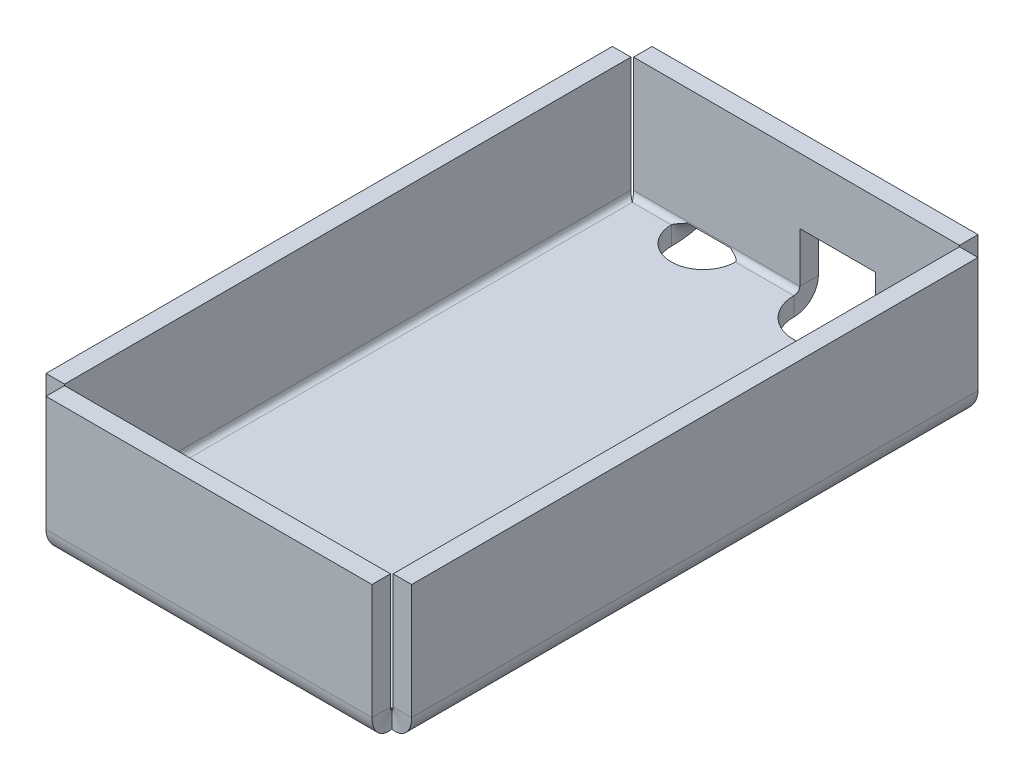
ISO-10303-21;
HEADER;
FILE_DESCRIPTION(('STEP AP214'),'2;1');
FILE_NAME('part.step','',(''),(''),'','','');
FILE_SCHEMA(('AUTOMOTIVE_DESIGN { 1 0 10303 214 1 1 1 1 }'));
ENDSEC;
DATA;
#1=APPLICATION_CONTEXT('core data for automotive mechanical design processes');
#2=APPLICATION_PROTOCOL_DEFINITION('international standard','automotive_design',2000,#1);
#3=PRODUCT_CONTEXT('',#1,'mechanical');
#4=PRODUCT('Part','Part','',(#3));
#5=PRODUCT_RELATED_PRODUCT_CATEGORY('part','',(#4));
#6=PRODUCT_DEFINITION_FORMATION('','',#4);
#7=PRODUCT_DEFINITION_CONTEXT('part definition',#1,'design');
#8=PRODUCT_DEFINITION('design','',#6,#7);
#9=PRODUCT_DEFINITION_SHAPE('','',#8);
#10=(LENGTH_UNIT() NAMED_UNIT(*) SI_UNIT(.MILLI.,.METRE.));
#11=(NAMED_UNIT(*) PLANE_ANGLE_UNIT() SI_UNIT($,.RADIAN.));
#12=(NAMED_UNIT(*) SI_UNIT($,.STERADIAN.) SOLID_ANGLE_UNIT());
#13=UNCERTAINTY_MEASURE_WITH_UNIT(LENGTH_MEASURE(1.E-05),#10,'distance_accuracy_value','');
#14=(GEOMETRIC_REPRESENTATION_CONTEXT(3) GLOBAL_UNCERTAINTY_ASSIGNED_CONTEXT((#13)) GLOBAL_UNIT_ASSIGNED_CONTEXT((#10,
#11,#12)) REPRESENTATION_CONTEXT('',''));
#15=CARTESIAN_POINT('',(0.,0.,0.));
#16=DIRECTION('',(0.,0.,1.));
#17=DIRECTION('',(1.,0.,0.));
#18=AXIS2_PLACEMENT_3D('',#15,#16,#17);
#19=CARTESIAN_POINT('',(0.,2.54,0.));
#20=DIRECTION('',(0.,1.,0.));
#21=DIRECTION('',(0.,0.,1.));
#22=AXIS2_PLACEMENT_3D('',#19,#20,#21);
#23=PLANE('',#22);
#24=DIRECTION('',(-1.,0.,0.));
#25=VECTOR('',#24,1.);
#26=CARTESIAN_POINT('',(0.,2.54,-76.5167255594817));
#27=LINE('',#26,#25);
#28=CARTESIAN_POINT('',(43.5385731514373,2.54,-76.5167255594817));
#29=VERTEX_POINT('',#28);
#30=CARTESIAN_POINT('',(32.6255247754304,2.54,-76.5167255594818));
#31=VERTEX_POINT('',#30);
#32=EDGE_CURVE('E586',#29,#31,#27,.T.);
#33=ORIENTED_EDGE('',*,*,#32,.T.);
#34=CARTESIAN_POINT('',(27.3952488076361,2.54,-76.5167255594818));
#35=DIRECTION('',(0.,1.,0.));
#36=DIRECTION('',(0.,0.,1.));
#37=AXIS2_PLACEMENT_3D('',#34,#35,#36);
#38=CIRCLE('',#37,5.23027596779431);
#39=CARTESIAN_POINT('',(22.1649728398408,2.53999999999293,-76.5167255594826));
#40=VERTEX_POINT('',#39);
#41=EDGE_CURVE('E266',#40,#31,#38,.T.);
#42=ORIENTED_EDGE('',*,*,#41,.F.);
#43=CARTESIAN_POINT('',(14.1520127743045,2.54,-76.5167255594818));
#44=VERTEX_POINT('',#43);
#45=EDGE_CURVE('E563',#40,#44,#27,.T.);
#46=ORIENTED_EDGE('',*,*,#45,.T.);
#47=CARTESIAN_POINT('',(9.7523978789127,2.54,-76.5167255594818));
#48=DIRECTION('',(0.,-1.,0.));
#49=DIRECTION('',(0.,0.,-1.));
#50=AXIS2_PLACEMENT_3D('',#47,#48,#49);
#51=CIRCLE('',#50,4.39961489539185);
#52=CARTESIAN_POINT('',(5.35278298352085,2.54,-76.5167255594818));
#53=VERTEX_POINT('',#52);
#54=EDGE_CURVE('E483',#44,#53,#51,.T.);
#55=ORIENTED_EDGE('',*,*,#54,.T.);
#56=CARTESIAN_POINT('',(0.,2.54,-76.5167255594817));
#57=VERTEX_POINT('',#56);
#58=EDGE_CURVE('E662',#53,#57,#27,.T.);
#59=ORIENTED_EDGE('',*,*,#58,.T.);
#60=DIRECTION('',(0.,0.,1.));
#61=VECTOR('',#60,1.);
#62=CARTESIAN_POINT('',(0.,2.54,-76.5167255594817));
#63=LINE('',#62,#61);
#64=CARTESIAN_POINT('',(0.,2.54,0.));
#65=VERTEX_POINT('',#64);
#66=EDGE_CURVE('E283',#57,#65,#63,.T.);
#67=ORIENTED_EDGE('',*,*,#66,.T.);
#68=DIRECTION('',(1.,0.,0.));
#69=VECTOR('',#68,1.);
#70=CARTESIAN_POINT('',(0.,2.54,0.));
#71=LINE('',#70,#69);
#72=CARTESIAN_POINT('',(43.5385731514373,2.54,0.));
#73=VERTEX_POINT('',#72);
#74=EDGE_CURVE('E286',#65,#73,#71,.T.);
#75=ORIENTED_EDGE('',*,*,#74,.T.);
#76=DIRECTION('',(0.,0.,-1.));
#77=VECTOR('',#76,1.);
#78=CARTESIAN_POINT('',(43.5385731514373,2.54,-76.5167255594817));
#79=LINE('',#78,#77);
#80=EDGE_CURVE('E612',#73,#29,#79,.T.);
#81=ORIENTED_EDGE('',*,*,#80,.T.);
#82=EDGE_LOOP('',(#33,#42,#46,#55,#59,#67,#75,#81));
#83=FACE_BOUND('',#82,.T.);
#84=ADVANCED_FACE('F42',(#83),#23,.T.);
#85=CARTESIAN_POINT('',(0.,0.,0.));
#86=DIRECTION('',(0.,1.,0.));
#87=DIRECTION('',(0.,0.,1.));
#88=AXIS2_PLACEMENT_3D('',#85,#86,#87);
#89=PLANE('',#88);
#90=CARTESIAN_POINT('',(27.3952488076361,0.,-76.5167255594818));
#91=DIRECTION('',(0.,1.,0.));
#92=DIRECTION('',(0.,0.,1.));
#93=AXIS2_PLACEMENT_3D('',#90,#91,#92);
#94=CIRCLE('',#93,5.23027596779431);
#95=CARTESIAN_POINT('',(22.1649728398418,0.,-76.5167255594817));
#96=VERTEX_POINT('',#95);
#97=CARTESIAN_POINT('',(32.6255247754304,0.,-76.5167255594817));
#98=VERTEX_POINT('',#97);
#99=EDGE_CURVE('E262',#96,#98,#94,.T.);
#100=ORIENTED_EDGE('',*,*,#99,.T.);
#101=DIRECTION('',(-1.,0.,0.));
#102=VECTOR('',#101,1.);
#103=CARTESIAN_POINT('',(0.,0.,-76.5167255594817));
#104=LINE('',#103,#102);
#105=CARTESIAN_POINT('',(43.5385731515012,0.,-76.5167255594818));
#106=VERTEX_POINT('',#105);
#107=EDGE_CURVE('E274',#106,#98,#104,.T.);
#108=ORIENTED_EDGE('',*,*,#107,.F.);
#109=DIRECTION('',(0.,0.,-1.));
#110=VECTOR('',#109,1.);
#111=CARTESIAN_POINT('',(43.5385731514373,0.,-76.5167255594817));
#112=LINE('',#111,#110);
#113=CARTESIAN_POINT('',(43.5385731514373,0.,0.));
#114=VERTEX_POINT('',#113);
#115=EDGE_CURVE('E289',#114,#106,#112,.T.);
#116=ORIENTED_EDGE('',*,*,#115,.F.);
#117=DIRECTION('',(1.,0.,0.));
#118=VECTOR('',#117,1.);
#119=CARTESIAN_POINT('',(0.,0.,0.));
#120=LINE('',#119,#118);
#121=CARTESIAN_POINT('',(1.18793863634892E-11,0.,0.));
#122=VERTEX_POINT('',#121);
#123=EDGE_CURVE('E296',#122,#114,#120,.T.);
#124=ORIENTED_EDGE('',*,*,#123,.F.);
#125=DIRECTION('',(0.,0.,1.));
#126=VECTOR('',#125,1.);
#127=CARTESIAN_POINT('',(0.,0.,-76.5167255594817));
#128=LINE('',#127,#126);
#129=CARTESIAN_POINT('',(0.,0.,-76.5167255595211));
#130=VERTEX_POINT('',#129);
#131=EDGE_CURVE('E301',#130,#122,#128,.T.);
#132=ORIENTED_EDGE('',*,*,#131,.F.);
#133=CARTESIAN_POINT('',(5.35278298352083,0.,-76.5167255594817));
#134=VERTEX_POINT('',#133);
#135=EDGE_CURVE('E285',#134,#130,#104,.T.);
#136=ORIENTED_EDGE('',*,*,#135,.F.);
#137=CARTESIAN_POINT('',(9.7523978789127,0.,-76.5167255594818));
#138=DIRECTION('',(0.,-1.,0.));
#139=DIRECTION('',(0.,0.,-1.));
#140=AXIS2_PLACEMENT_3D('',#137,#138,#139);
#141=CIRCLE('',#140,4.39961489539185);
#142=CARTESIAN_POINT('',(14.1520127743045,0.,-76.5167255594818));
#143=VERTEX_POINT('',#142);
#144=EDGE_CURVE('E487',#143,#134,#141,.T.);
#145=ORIENTED_EDGE('',*,*,#144,.F.);
#146=EDGE_CURVE('E277',#96,#143,#104,.T.);
#147=ORIENTED_EDGE('',*,*,#146,.F.);
#148=EDGE_LOOP('',(#100,#108,#116,#124,#132,#136,#145,#147));
#149=FACE_BOUND('',#148,.T.);
#150=ADVANCED_FACE('F273',(#149),#89,.F.);
#151=CARTESIAN_POINT('',(426.122200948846,3.302,-76.5167255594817));
#152=DIRECTION('',(-1.,0.,0.));
#153=DIRECTION('',(0.,0.,1.));
#154=AXIS2_PLACEMENT_3D('',#151,#152,#153);
#155=CYLINDRICAL_SURFACE('',#154,3.302);
#156=ORIENTED_EDGE('',*,*,#107,.T.);
#157=CARTESIAN_POINT('',(32.5697190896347,3.30199999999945,-79.8187255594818));
#158=CARTESIAN_POINT('',(32.5697201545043,3.19224030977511,-79.8187437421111));
#159=CARTESIAN_POINT('',(32.5699183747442,3.08248702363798,-79.813253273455));
#160=CARTESIAN_POINT('',(32.5706758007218,2.86406173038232,-79.7913905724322));
#161=CARTESIAN_POINT('',(32.5712350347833,2.75538980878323,-79.7750174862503));
#162=CARTESIAN_POINT('',(32.5726791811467,2.54050661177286,-79.7315844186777));
#163=CARTESIAN_POINT('',(32.5735632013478,2.43428943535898,-79.7045536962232));
#164=CARTESIAN_POINT('',(32.5756379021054,2.22511291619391,-79.6401061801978));
#165=CARTESIAN_POINT('',(32.5768285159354,2.12215287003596,-79.6026916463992));
#166=CARTESIAN_POINT('',(32.5803978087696,1.85026172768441,-79.4882593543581));
#167=CARTESIAN_POINT('',(32.5830271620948,1.68520224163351,-79.4017877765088));
#168=CARTESIAN_POINT('',(32.5887262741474,1.37209764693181,-79.2024563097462));
#169=CARTESIAN_POINT('',(32.5917958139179,1.2240441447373,-79.0896095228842));
#170=CARTESIAN_POINT('',(32.5980381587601,0.948863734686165,-78.8405995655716));
#171=CARTESIAN_POINT('',(32.6012110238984,0.821749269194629,-78.704422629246));
#172=CARTESIAN_POINT('',(32.6073029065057,0.592136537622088,-78.4125968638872));
#173=CARTESIAN_POINT('',(32.6102218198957,0.489648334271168,-78.2569401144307));
#174=CARTESIAN_POINT('',(32.6154744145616,0.312220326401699,-77.9305699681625));
#175=CARTESIAN_POINT('',(32.6178078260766,0.237293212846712,-77.7598496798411));
#176=CARTESIAN_POINT('',(32.6216309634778,0.117246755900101,-77.4083298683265));
#177=CARTESIAN_POINT('',(32.6231216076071,0.0720949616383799,-77.2275415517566));
#178=CARTESIAN_POINT('',(32.6245766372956,0.028302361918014,-76.9571347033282));
#179=CARTESIAN_POINT('',(32.6249315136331,0.0176868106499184,-76.8693089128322));
#180=CARTESIAN_POINT('',(32.6254055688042,0.00354269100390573,-76.6932439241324));
#181=CARTESIAN_POINT('',(32.6255251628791,1.63692225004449E-06,-76.6050057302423));
#182=CARTESIAN_POINT('',(32.6255247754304,0.,-76.5167255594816));
#183=B_SPLINE_CURVE_WITH_KNOTS('',3,(#157,#158,#159,#160,#161,#162,#163,#164,#165,#166,#167,
#168,#169,#170,#171,#172,#173,#174,#175,#176,#177,#178,#179,#180,#181,#182),.UNSPECIFIED.,.F.,
.F.,(4,2,2,2,2,2,2,2,2,2,2,2,4),(0.,0.329130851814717,0.658287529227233,0.986546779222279,
1.31473464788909,1.87096718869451,2.42692400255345,2.98320999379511,3.53972290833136,
4.09649175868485,4.65265280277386,4.91780714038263,5.18249309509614),.UNSPECIFIED.);
#184=CARTESIAN_POINT('',(32.5697190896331,3.30199999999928,-79.8187255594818));
#185=VERTEX_POINT('',#184);
#186=EDGE_CURVE('E246',#185,#98,#183,.T.);
#187=ORIENTED_EDGE('',*,*,#186,.F.);
#188=DIRECTION('',(-1.,0.,0.));
#189=VECTOR('',#188,1.);
#190=CARTESIAN_POINT('',(426.122200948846,3.302,-79.8187255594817));
#191=LINE('',#190,#189);
#192=CARTESIAN_POINT('',(44.1209680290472,3.302,-79.8187255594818));
#193=VERTEX_POINT('',#192);
#194=EDGE_CURVE('E375',#193,#185,#191,.T.);
#195=ORIENTED_EDGE('',*,*,#194,.F.);
#196=CARTESIAN_POINT('',(43.5385731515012,3.302,-76.5167255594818));
#197=DIRECTION('',(0.98479942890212,0.,0.173695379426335));
#198=DIRECTION('',(-0.173695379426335,0.,0.98479942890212));
#199=AXIS2_PLACEMENT_3D('',#196,#197,#198);
#200=ELLIPSE('',#199,3.35296701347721,3.302);
#201=EDGE_CURVE('E282',#193,#106,#200,.F.);
#202=ORIENTED_EDGE('',*,*,#201,.T.);
#203=EDGE_LOOP('',(#156,#187,#195,#202));
#204=FACE_BOUND('',#203,.T.);
#205=ADVANCED_FACE('F280',(#204),#155,.T.);
#206=CARTESIAN_POINT('',(22.2207785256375,3.302,-79.8187255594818));
#207=VERTEX_POINT('',#206);
#208=CARTESIAN_POINT('',(-0.582394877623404,3.302,-79.8187255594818));
#209=VERTEX_POINT('',#208);
#210=EDGE_CURVE('E378',#207,#209,#191,.T.);
#211=ORIENTED_EDGE('',*,*,#210,.F.);
#212=CARTESIAN_POINT('',(22.1649728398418,0.,-76.516725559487));
#213=CARTESIAN_POINT('',(22.1649715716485,-1.82058191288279E-05,-76.6265120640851));
#214=CARTESIAN_POINT('',(22.1651618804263,0.00547495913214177,-76.7362922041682));
#215=CARTESIAN_POINT('',(22.1659015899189,0.0273483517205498,-76.9547704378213));
#216=CARTESIAN_POINT('',(22.1664510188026,0.0437294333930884,-77.0634684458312));
#217=CARTESIAN_POINT('',(22.1678829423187,0.0871835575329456,-77.2784018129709));
#218=CARTESIAN_POINT('',(22.1687645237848,0.114227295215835,-77.3846430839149));
#219=CARTESIAN_POINT('',(22.1708315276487,0.178705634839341,-77.5938654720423));
#220=CARTESIAN_POINT('',(22.1720168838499,0.216137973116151,-77.696847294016));
#221=CARTESIAN_POINT('',(22.1755660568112,0.330607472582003,-77.9687531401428));
#222=CARTESIAN_POINT('',(22.178176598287,0.417095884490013,-78.1338055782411));
#223=CARTESIAN_POINT('',(22.183848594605,0.616459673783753,-78.44689302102));
#224=CARTESIAN_POINT('',(22.1869098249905,0.729321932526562,-78.5949364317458));
#225=CARTESIAN_POINT('',(22.1931468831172,0.978359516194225,-78.8700923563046));
#226=CARTESIAN_POINT('',(22.1963227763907,1.11454834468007,-78.9971926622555));
#227=CARTESIAN_POINT('',(22.2024280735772,1.40639522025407,-79.2267754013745));
#228=CARTESIAN_POINT('',(22.2053573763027,1.56206119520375,-79.3292477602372));
#229=CARTESIAN_POINT('',(22.210640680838,1.88844818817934,-79.5066436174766));
#230=CARTESIAN_POINT('',(22.2129944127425,2.05917621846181,-79.5815541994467));
#231=CARTESIAN_POINT('',(22.2168412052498,2.41070874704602,-79.7015664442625));
#232=CARTESIAN_POINT('',(22.2183352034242,2.59150203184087,-79.7467005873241));
#233=CARTESIAN_POINT('',(22.2198068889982,2.86185996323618,-79.7904579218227));
#234=CARTESIAN_POINT('',(22.2201689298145,2.9496324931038,-79.8010604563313));
#235=CARTESIAN_POINT('',(22.2206547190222,3.12559002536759,-79.8151872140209));
#236=CARTESIAN_POINT('',(22.2207788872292,3.21377402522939,-79.8187239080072));
#237=CARTESIAN_POINT('',(22.2207785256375,3.302,-79.8187255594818));
#238=B_SPLINE_CURVE_WITH_KNOTS('',3,(#212,#213,#214,#215,#216,#217,#218,#219,#220,#221,#222,
#223,#224,#225,#226,#227,#228,#229,#230,#231,#232,#233,#234,#235,#236,#237),.UNSPECIFIED.,.F.,
.F.,(4,2,2,2,2,2,2,2,2,2,2,2,4),(0.,0.329211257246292,0.658448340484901,0.986786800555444,
1.31505377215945,1.87129022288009,2.42725058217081,2.98353387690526,3.54004433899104,
4.0968152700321,4.65297786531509,4.9179694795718,5.18249298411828),.UNSPECIFIED.);
#239=EDGE_CURVE('E256',#96,#207,#238,.T.);
#240=ORIENTED_EDGE('',*,*,#239,.F.);
#241=ORIENTED_EDGE('',*,*,#146,.T.);
#242=CARTESIAN_POINT('',(12.758067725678,2.54,-79.7295996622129));
#243=CARTESIAN_POINT('',(12.7780961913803,2.46086097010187,-79.7108312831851));
#244=CARTESIAN_POINT('',(12.8006281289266,2.38307977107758,-79.6892950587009));
#245=CARTESIAN_POINT('',(12.8497787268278,2.23061070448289,-79.6410984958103));
#246=CARTESIAN_POINT('',(12.8763899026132,2.15591748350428,-79.6144475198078));
#247=CARTESIAN_POINT('',(12.9327970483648,2.0098704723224,-79.5564247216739));
#248=CARTESIAN_POINT('',(12.9625860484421,1.93850984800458,-79.5250631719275));
#249=CARTESIAN_POINT('',(13.0244771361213,1.79893842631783,-79.4578162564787));
#250=CARTESIAN_POINT('',(13.0565806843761,1.7307296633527,-79.4219280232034));
#251=CARTESIAN_POINT('',(13.111069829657,1.62002178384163,-79.3586844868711));
#252=CARTESIAN_POINT('',(13.1330703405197,1.57662885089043,-79.3325478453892));
#253=CARTESIAN_POINT('',(13.1774540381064,1.49122715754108,-79.2784028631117));
#254=CARTESIAN_POINT('',(13.199837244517,1.44921846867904,-79.2503944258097));
#255=CARTESIAN_POINT('',(13.2673790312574,1.32531805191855,-79.1636300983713));
#256=CARTESIAN_POINT('',(13.3129355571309,1.24554037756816,-79.1021285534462));
#257=CARTESIAN_POINT('',(13.4039196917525,1.09173116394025,-78.971942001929));
#258=CARTESIAN_POINT('',(13.4493469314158,1.01771000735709,-78.9032445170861));
#259=CARTESIAN_POINT('',(13.5387230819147,0.875845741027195,-78.758870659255));
#260=CARTESIAN_POINT('',(13.5826723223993,0.808001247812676,-78.6831958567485));
#261=CARTESIAN_POINT('',(13.6608534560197,0.689688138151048,-78.5381779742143));
#262=CARTESIAN_POINT('',(13.6954857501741,0.638206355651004,-78.4698753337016));
#263=CARTESIAN_POINT('',(13.7623437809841,0.540215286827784,-78.3286674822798));
#264=CARTESIAN_POINT('',(13.7945696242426,0.493705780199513,-78.255762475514));
#265=CARTESIAN_POINT('',(13.8559090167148,0.406137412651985,-78.1056626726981));
#266=CARTESIAN_POINT('',(13.8850272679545,0.365070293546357,-78.0284746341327));
#267=CARTESIAN_POINT('',(13.9395769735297,0.288773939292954,-77.8700179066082));
#268=CARTESIAN_POINT('',(13.9650091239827,0.253543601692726,-77.7887499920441));
#269=CARTESIAN_POINT('',(14.0080202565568,0.194382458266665,-77.635466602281));
#270=CARTESIAN_POINT('',(14.0262054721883,0.169546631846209,-77.5639695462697));
#271=CARTESIAN_POINT('',(14.0592048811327,0.124679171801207,-77.4187290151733));
#272=CARTESIAN_POINT('',(14.074019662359,0.104646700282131,-77.3449859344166));
#273=CARTESIAN_POINT('',(14.0999677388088,0.0696720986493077,-77.1957858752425));
#274=CARTESIAN_POINT('',(14.1111065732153,0.0547223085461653,-77.1203316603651));
#275=CARTESIAN_POINT('',(14.1294888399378,0.030092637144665,-76.96812762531));
#276=CARTESIAN_POINT('',(14.1367342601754,0.0204100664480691,-76.8913784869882));
#277=CARTESIAN_POINT('',(14.1453032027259,0.0089620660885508,-76.7648541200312));
#278=CARTESIAN_POINT('',(14.1478191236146,0.00560196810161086,-76.7152959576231));
#279=CARTESIAN_POINT('',(14.1511743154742,0.0011210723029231,-76.616069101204));
#280=CARTESIAN_POINT('',(14.1520151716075,-1.842620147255E-06,-76.5664005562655));
#281=CARTESIAN_POINT('',(14.1520127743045,0.,-76.5167255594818));
#282=B_SPLINE_CURVE_WITH_KNOTS('',3,(#242,#243,#244,#245,#246,#247,#248,#249,#250,#251,#252,
#253,#254,#255,#256,#257,#258,#259,#260,#261,#262,#263,#264,#265,#266,#267,#268,#269,#270,#271,
#272,#273,#274,#275,#276,#277,#278,#279,#280,#281),.UNSPECIFIED.,.F.,.F.,(4,2,2,2,2,2,2,2,2,2,2,
2,2,2,2,2,2,2,2,4),(0.,0.251105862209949,0.501756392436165,0.751868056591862,1.00213896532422,
1.16777413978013,1.33341786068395,1.66466176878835,1.99648989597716,2.32824351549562,
2.60481653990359,2.88137730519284,3.15751349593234,3.43359747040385,3.66688694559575,
3.90013569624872,4.13303134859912,4.36580797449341,4.51494178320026,4.66393439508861),.UNSPECIFIED.);
#283=CARTESIAN_POINT('',(12.758067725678,2.54,-79.7295996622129));
#284=VERTEX_POINT('',#283);
#285=EDGE_CURVE('E499',#284,#143,#282,.T.);
#286=ORIENTED_EDGE('',*,*,#285,.F.);
#287=DIRECTION('',(-1.,0.,0.));
#288=VECTOR('',#287,1.);
#289=CARTESIAN_POINT('',(426.122200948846,2.54,-79.7295996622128));
#290=LINE('',#289,#288);
#291=CARTESIAN_POINT('',(6.74672803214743,2.54,-79.7295996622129));
#292=VERTEX_POINT('',#291);
#293=EDGE_CURVE('E497',#284,#292,#290,.T.);
#294=ORIENTED_EDGE('',*,*,#293,.T.);
#295=CARTESIAN_POINT('',(5.35278298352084,0.,-76.5167255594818));
#296=CARTESIAN_POINT('',(5.35276009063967,-1.5319322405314E-05,-76.5947137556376));
#297=CARTESIAN_POINT('',(5.35484540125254,0.00276226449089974,-76.6726926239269));
#298=CARTESIAN_POINT('',(5.36311164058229,0.0137874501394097,-76.8280001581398));
#299=CARTESIAN_POINT('',(5.36929018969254,0.0220318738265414,-76.9053291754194));
#300=CARTESIAN_POINT('',(5.38557396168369,0.0438104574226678,-77.0583425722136));
#301=CARTESIAN_POINT('',(5.39565569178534,0.0573129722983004,-77.1340339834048));
#302=CARTESIAN_POINT('',(5.41953179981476,0.0894059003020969,-77.2837351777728));
#303=CARTESIAN_POINT('',(5.43332657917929,0.107996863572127,-77.3577447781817));
#304=CARTESIAN_POINT('',(5.46426662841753,0.149977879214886,-77.5034862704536));
#305=CARTESIAN_POINT('',(5.48140441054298,0.173357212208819,-77.5752228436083));
#306=CARTESIAN_POINT('',(5.51881002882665,0.224655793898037,-77.7162232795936));
#307=CARTESIAN_POINT('',(5.53907914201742,0.252576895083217,-77.7854861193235));
#308=CARTESIAN_POINT('',(5.60406340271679,0.342778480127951,-77.9892225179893));
#309=CARTESIAN_POINT('',(5.65294959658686,0.411489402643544,-78.1196171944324));
#310=CARTESIAN_POINT('',(5.73553861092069,0.530214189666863,-78.3131357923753));
#311=CARTESIAN_POINT('',(5.76648786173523,0.57519751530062,-78.3806657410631));
#312=CARTESIAN_POINT('',(5.83038802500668,0.66950251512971,-78.5116349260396));
#313=CARTESIAN_POINT('',(5.86333907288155,0.718824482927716,-78.5750738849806));
#314=CARTESIAN_POINT('',(5.96464054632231,0.873014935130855,-78.759251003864));
#315=CARTESIAN_POINT('',(6.03536542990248,0.984003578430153,-78.8736809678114));
#316=CARTESIAN_POINT('',(6.14969245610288,1.17346407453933,-79.0429193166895));
#317=CARTESIAN_POINT('',(6.19289131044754,1.24730606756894,-79.1033362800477));
#318=CARTESIAN_POINT('',(6.27878229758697,1.40018719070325,-79.2177296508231));
#319=CARTESIAN_POINT('',(6.32147424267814,1.47922817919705,-79.2717037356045));
#320=CARTESIAN_POINT('',(6.40519235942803,1.64202247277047,-79.3727431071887));
#321=CARTESIAN_POINT('',(6.44622347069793,1.72575971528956,-79.4198301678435));
#322=CARTESIAN_POINT('',(6.52506734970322,1.89818374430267,-79.5070137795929));
#323=CARTESIAN_POINT('',(6.5628826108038,1.98686660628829,-79.5471157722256));
#324=CARTESIAN_POINT('',(6.62683433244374,2.15187303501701,-79.6129703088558));
#325=CARTESIAN_POINT('',(6.65382564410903,2.22735145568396,-79.640001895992));
#326=CARTESIAN_POINT('',(6.70364591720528,2.38141762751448,-79.6888340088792));
#327=CARTESIAN_POINT('',(6.72646961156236,2.46000916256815,-79.7106279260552));
#328=CARTESIAN_POINT('',(6.74672803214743,2.54000000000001,-79.7295996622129));
#329=B_SPLINE_CURVE_WITH_KNOTS('',3,(#295,#296,#297,#298,#299,#300,#301,#302,#303,#304,#305,
#306,#307,#308,#309,#310,#311,#312,#313,#314,#315,#316,#317,#318,#319,#320,#321,#322,#323,#324,
#325,#326,#327,#328),.UNSPECIFIED.,.F.,.F.,(4,2,2,2,2,2,2,2,2,2,2,2,2,2,2,2,4),(0.,
0.233872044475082,0.467608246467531,0.699958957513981,0.932334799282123,1.16419601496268,
1.39615204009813,1.86014873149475,2.12048978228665,2.38084846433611,2.90219472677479,
3.21613394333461,3.53018599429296,3.8432226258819,4.15601429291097,4.40949356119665,
4.66329099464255),.UNSPECIFIED.);
#330=EDGE_CURVE('E490',#134,#292,#329,.T.);
#331=ORIENTED_EDGE('',*,*,#330,.F.);
#332=ORIENTED_EDGE('',*,*,#135,.T.);
#333=CARTESIAN_POINT('',(4.88498130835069E-12,3.302,-76.5167255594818));
#334=DIRECTION('',(-0.98479942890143,0.,0.173695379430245));
#335=DIRECTION('',(-0.173695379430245,0.,-0.98479942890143));
#336=AXIS2_PLACEMENT_3D('',#333,#334,#335);
#337=ELLIPSE('',#336,3.35296701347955,3.302);
#338=EDGE_CURVE('E359',#130,#209,#337,.F.);
#339=ORIENTED_EDGE('',*,*,#338,.T.);
#340=EDGE_LOOP('',(#211,#240,#241,#286,#294,#331,#332,#339));
#341=FACE_BOUND('',#340,.T.);
#342=ADVANCED_FACE('F571',(#341),#155,.T.);
#343=CARTESIAN_POINT('',(426.122200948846,3.302,-76.5167255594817));
#344=DIRECTION('',(-1.,0.,0.));
#345=DIRECTION('',(0.,0.,1.));
#346=AXIS2_PLACEMENT_3D('',#343,#344,#345);
#347=CYLINDRICAL_SURFACE('',#346,0.762);
#348=CARTESIAN_POINT('',(32.5697190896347,3.30199999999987,-77.2787255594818));
#349=CARTESIAN_POINT('',(32.569733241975,3.25937191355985,-77.2787631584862));
#350=CARTESIAN_POINT('',(32.5702858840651,3.21675922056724,-77.2751508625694));
#351=CARTESIAN_POINT('',(32.5723516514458,3.13279852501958,-77.2609097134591));
#352=CARTESIAN_POINT('',(32.5738635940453,3.09144903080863,-77.2502894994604));
#353=CARTESIAN_POINT('',(32.5777326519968,3.01112581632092,-77.2223102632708));
#354=CARTESIAN_POINT('',(32.5800900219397,2.9721528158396,-77.2049492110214));
#355=CARTESIAN_POINT('',(32.5853604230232,2.89767204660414,-77.1640028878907));
#356=CARTESIAN_POINT('',(32.5882734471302,2.86216423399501,-77.1404176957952));
#357=CARTESIAN_POINT('',(32.5943547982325,2.79536031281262,-77.0875041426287));
#358=CARTESIAN_POINT('',(32.5975246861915,2.76409360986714,-77.0581388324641));
#359=CARTESIAN_POINT('',(32.6037473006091,2.70691463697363,-76.9945795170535));
#360=CARTESIAN_POINT('',(32.6068000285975,2.68100229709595,-76.9603855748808));
#361=CARTESIAN_POINT('',(32.6124623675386,2.6351452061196,-76.8879348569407));
#362=CARTESIAN_POINT('',(32.6150697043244,2.61523070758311,-76.849658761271));
#363=CARTESIAN_POINT('',(32.6195263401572,2.58213458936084,-76.7702689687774));
#364=CARTESIAN_POINT('',(32.6213761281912,2.56894862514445,-76.7291571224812));
#365=CARTESIAN_POINT('',(32.6236556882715,2.55290510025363,-76.6592902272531));
#366=CARTESIAN_POINT('',(32.6243532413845,2.54807005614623,-76.6309821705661));
#367=CARTESIAN_POINT('',(32.6252895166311,2.5416171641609,-76.5740288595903));
#368=CARTESIAN_POINT('',(32.625528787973,2.53999546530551,-76.5453840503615));
#369=CARTESIAN_POINT('',(32.6255247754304,2.54,-76.5167255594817));
#370=B_SPLINE_CURVE_WITH_KNOTS('',3,(#348,#349,#350,#351,#352,#353,#354,#355,#356,#357,#358,
#359,#360,#361,#362,#363,#364,#365,#366,#367,#368,#369),.UNSPECIFIED.,.F.,.F.,(4,2,2,2,2,2,2,2,
2,2,4),(0.,0.127706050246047,0.255254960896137,0.382842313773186,0.510428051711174,
0.63885753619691,0.76728534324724,0.896350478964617,1.02533217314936,1.1113376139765,
1.19723992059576),.UNSPECIFIED.);
#371=CARTESIAN_POINT('',(32.5697190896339,3.302,-77.2787255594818));
#372=VERTEX_POINT('',#371);
#373=EDGE_CURVE('E688',#372,#31,#370,.T.);
#374=ORIENTED_EDGE('',*,*,#373,.T.);
#375=ORIENTED_EDGE('',*,*,#32,.F.);
#376=CARTESIAN_POINT('',(43.5385731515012,3.302,-76.5167255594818));
#377=DIRECTION('',(0.794514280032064,0.,0.607245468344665));
#378=DIRECTION('',(-0.607245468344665,0.,0.794514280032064));
#379=AXIS2_PLACEMENT_3D('',#376,#377,#378);
#380=ELLIPSE('',#379,0.959076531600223,0.762);
#381=CARTESIAN_POINT('',(44.1209680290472,3.302,-77.2787255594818));
#382=VERTEX_POINT('',#381);
#383=EDGE_CURVE('E349',#382,#29,#380,.F.);
#384=ORIENTED_EDGE('',*,*,#383,.F.);
#385=DIRECTION('',(-1.,0.,0.));
#386=VECTOR('',#385,1.);
#387=CARTESIAN_POINT('',(426.122200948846,3.302,-77.2787255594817));
#388=LINE('',#387,#386);
#389=EDGE_CURVE('E348',#382,#372,#388,.T.);
#390=ORIENTED_EDGE('',*,*,#389,.T.);
#391=EDGE_LOOP('',(#374,#375,#384,#390));
#392=FACE_BOUND('',#391,.T.);
#393=ADVANCED_FACE('F687',(#392),#347,.F.);
#394=CARTESIAN_POINT('',(22.1649728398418,2.54,-76.516725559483));
#395=CARTESIAN_POINT('',(22.1649668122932,2.53996246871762,-76.559356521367));
#396=CARTESIAN_POINT('',(22.1655095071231,2.54357518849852,-76.6019718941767));
#397=CARTESIAN_POINT('',(22.1675598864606,2.55781817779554,-76.6859381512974));
#398=CARTESIAN_POINT('',(22.1690663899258,2.56843985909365,-76.7272905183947));
#399=CARTESIAN_POINT('',(22.1729131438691,2.59642332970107,-76.8076197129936));
#400=CARTESIAN_POINT('',(22.1752536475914,2.61378716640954,-76.8465958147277));
#401=CARTESIAN_POINT('',(22.1804949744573,2.65474006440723,-76.9210817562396));
#402=CARTESIAN_POINT('',(22.1833957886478,2.67832902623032,-76.9565916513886));
#403=CARTESIAN_POINT('',(22.1894627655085,2.73124794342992,-77.0233951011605));
#404=CARTESIAN_POINT('',(22.1926305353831,2.76061433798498,-77.054659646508));
#405=CARTESIAN_POINT('',(22.198859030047,2.82417474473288,-77.111833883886));
#406=CARTESIAN_POINT('',(22.2019197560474,2.85836870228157,-77.1377436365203));
#407=CARTESIAN_POINT('',(22.2076095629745,2.93082010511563,-77.1835967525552));
#408=CARTESIAN_POINT('',(22.2102364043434,2.96909705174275,-77.2035095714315));
#409=CARTESIAN_POINT('',(22.2147196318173,3.04848901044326,-77.2366023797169));
#410=CARTESIAN_POINT('',(22.2165765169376,3.0896021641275,-77.2497867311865));
#411=CARTESIAN_POINT('',(22.2188741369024,3.15946455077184,-77.2658257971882));
#412=CARTESIAN_POINT('',(22.2195806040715,3.18776672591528,-77.2706588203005));
#413=CARTESIAN_POINT('',(22.2205328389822,3.24470828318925,-77.2771090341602));
#414=CARTESIAN_POINT('',(22.2207791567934,3.27334722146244,-77.2787300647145));
#415=CARTESIAN_POINT('',(22.2207785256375,3.302,-77.2787255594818));
#416=B_SPLINE_CURVE_WITH_KNOTS('',3,(#394,#395,#396,#397,#398,#399,#400,#401,#402,#403,#404,
#405,#406,#407,#408,#409,#410,#411,#412,#413,#414,#415),.UNSPECIFIED.,.F.,.F.,(4,2,2,2,2,2,2,2,
2,2,4),(0.,0.12771385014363,0.255271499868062,0.382867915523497,0.510462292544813,
0.638888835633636,0.767313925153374,0.896382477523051,1.0253672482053,1.11135506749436,
1.19724002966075),.UNSPECIFIED.);
#417=CARTESIAN_POINT('',(22.2207785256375,3.302,-77.2787255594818));
#418=VERTEX_POINT('',#417);
#419=EDGE_CURVE('E719',#40,#418,#416,.T.);
#420=ORIENTED_EDGE('',*,*,#419,.T.);
#421=CARTESIAN_POINT('',(-0.582394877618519,3.302,-77.2787255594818));
#422=VERTEX_POINT('',#421);
#423=EDGE_CURVE('E358',#418,#422,#388,.T.);
#424=ORIENTED_EDGE('',*,*,#423,.T.);
#425=CARTESIAN_POINT('',(4.88498130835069E-12,3.302,-76.5167255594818));
#426=DIRECTION('',(-0.794514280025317,0.,0.607245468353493));
#427=DIRECTION('',(-0.607245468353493,0.,-0.794514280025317));
#428=AXIS2_PLACEMENT_3D('',#425,#426,#427);
#429=ELLIPSE('',#428,0.959076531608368,0.762);
#430=EDGE_CURVE('E352',#57,#422,#429,.F.);
#431=ORIENTED_EDGE('',*,*,#430,.F.);
#432=ORIENTED_EDGE('',*,*,#58,.F.);
#433=CARTESIAN_POINT('',(5.35278298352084,2.54,-76.5167255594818));
#434=CARTESIAN_POINT('',(5.35278025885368,2.53999917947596,-76.5238800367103));
#435=CARTESIAN_POINT('',(5.35310931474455,2.54010083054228,-76.5310304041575));
#436=CARTESIAN_POINT('',(5.35440755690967,2.54050130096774,-76.5452568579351));
#437=CARTESIAN_POINT('',(5.35537579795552,2.54079982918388,-76.5523330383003));
#438=CARTESIAN_POINT('',(5.35916867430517,2.54196814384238,-76.5731793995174));
#439=CARTESIAN_POINT('',(5.36288297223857,2.54311115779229,-76.5867780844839));
#440=CARTESIAN_POINT('',(5.37361677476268,2.54642001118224,-76.6168920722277));
#441=CARTESIAN_POINT('',(5.38127200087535,2.54878308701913,-76.6331522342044));
#442=CARTESIAN_POINT('',(5.39896063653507,2.55425201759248,-76.6642693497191));
#443=CARTESIAN_POINT('',(5.40900867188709,2.55736244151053,-76.679116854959));
#444=CARTESIAN_POINT('',(5.42958232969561,2.56375935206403,-76.705974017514));
#445=CARTESIAN_POINT('',(5.43995205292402,2.5669946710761,-76.718118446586));
#446=CARTESIAN_POINT('',(5.4616325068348,2.57378849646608,-76.7414459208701));
#447=CARTESIAN_POINT('',(5.47294400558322,2.57734726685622,-76.7526281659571));
#448=CARTESIAN_POINT('',(5.50794162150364,2.58839148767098,-76.7849197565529));
#449=CARTESIAN_POINT('',(5.53267961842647,2.59624134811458,-76.804760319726));
#450=CARTESIAN_POINT('',(5.57811003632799,2.61078608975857,-76.8378418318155));
#451=CARTESIAN_POINT('',(5.59849874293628,2.61735633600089,-76.851575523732));
#452=CARTESIAN_POINT('',(5.63996218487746,2.63081806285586,-76.8778015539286));
#453=CARTESIAN_POINT('',(5.66103704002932,2.63770959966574,-76.8902936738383));
#454=CARTESIAN_POINT('',(5.72506172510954,2.65882054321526,-76.9262904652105));
#455=CARTESIAN_POINT('',(5.76873369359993,2.67345145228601,-76.9482618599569));
#456=CARTESIAN_POINT('',(5.85744748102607,2.70379007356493,-76.9894235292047));
#457=CARTESIAN_POINT('',(5.90249762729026,2.71950567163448,-77.0085893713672));
#458=CARTESIAN_POINT('',(5.9931031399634,2.75189668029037,-77.0445668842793));
#459=CARTESIAN_POINT('',(6.0386577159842,2.76857072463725,-77.0613817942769));
#460=CARTESIAN_POINT('',(6.11855023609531,2.79879473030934,-77.0892086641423));
#461=CARTESIAN_POINT('',(6.15284866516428,2.81208515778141,-77.1006212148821));
#462=CARTESIAN_POINT('',(6.22144951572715,2.83946058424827,-77.1225386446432));
#463=CARTESIAN_POINT('',(6.25575192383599,2.85354612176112,-77.1330428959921));
#464=CARTESIAN_POINT('',(6.32426733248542,2.88269087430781,-77.1532303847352));
#465=CARTESIAN_POINT('',(6.35848003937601,2.89775188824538,-77.1629120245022));
#466=CARTESIAN_POINT('',(6.42615846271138,2.92885116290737,-77.1813518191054));
#467=CARTESIAN_POINT('',(6.45962814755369,2.94487458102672,-77.1901201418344));
#468=CARTESIAN_POINT('',(6.52585677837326,2.97855755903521,-77.2069304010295));
#469=CARTESIAN_POINT('',(6.55861674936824,2.99621453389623,-77.2149734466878));
#470=CARTESIAN_POINT('',(6.62284401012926,3.03392640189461,-77.2303068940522));
#471=CARTESIAN_POINT('',(6.65431470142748,3.05397435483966,-77.2375993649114));
#472=CARTESIAN_POINT('',(6.69527352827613,3.08372716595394,-77.2468395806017));
#473=CARTESIAN_POINT('',(6.70586331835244,3.09177579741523,-77.2492042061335));
#474=CARTESIAN_POINT('',(6.72663936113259,3.10848439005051,-77.253794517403));
#475=CARTESIAN_POINT('',(6.73682413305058,3.11714632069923,-77.2560197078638));
#476=CARTESIAN_POINT('',(6.74672803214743,3.12615384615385,-77.2581580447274));
#477=B_SPLINE_CURVE_WITH_KNOTS('',3,(#433,#434,#435,#436,#437,#438,#439,#440,#441,#442,#443,
#444,#445,#446,#447,#448,#449,#450,#451,#452,#453,#454,#455,#456,#457,#458,#459,#460,#461,#462,
#463,#464,#465,#466,#467,#468,#469,#470,#471,#472,#473,#474,#475,#476),.UNSPECIFIED.,.F.,.F.,(4,
2,2,2,2,2,2,2,2,2,2,2,2,2,2,2,2,2,2,2,2,4),(0.,0.0214476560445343,0.042863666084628,
0.0850735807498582,0.139152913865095,0.193571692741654,0.242383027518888,0.291234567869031,
0.38899116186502,0.465292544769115,0.541607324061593,0.69452924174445,0.848712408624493,
1.00268099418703,1.11820394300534,1.23380609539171,1.34962786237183,1.46397849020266,
1.57815116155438,1.69200014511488,1.73251147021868,1.77315936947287),.UNSPECIFIED.);
#478=CARTESIAN_POINT('',(6.74672803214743,3.12615384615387,-77.2581580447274));
#479=VERTEX_POINT('',#478);
#480=EDGE_CURVE('E529',#53,#479,#477,.T.);
#481=ORIENTED_EDGE('',*,*,#480,.T.);
#482=DIRECTION('',(-1.,0.,0.));
#483=VECTOR('',#482,1.);
#484=CARTESIAN_POINT('',(426.122200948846,3.12615384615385,-77.2581580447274));
#485=LINE('',#484,#483);
#486=CARTESIAN_POINT('',(12.758067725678,3.12615384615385,-77.2581580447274));
#487=VERTEX_POINT('',#486);
#488=EDGE_CURVE('E534',#487,#479,#485,.T.);
#489=ORIENTED_EDGE('',*,*,#488,.F.);
#490=CARTESIAN_POINT('',(12.758067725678,3.12615384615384,-77.2581580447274));
#491=CARTESIAN_POINT('',(12.7695085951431,3.11575616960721,-77.2556871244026));
#492=CARTESIAN_POINT('',(12.7813120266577,3.10580726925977,-77.2531013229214));
#493=CARTESIAN_POINT('',(12.8054654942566,3.08668267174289,-77.2477404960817));
#494=CARTESIAN_POINT('',(12.8178147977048,3.0775059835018,-77.2449657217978));
#495=CARTESIAN_POINT('',(12.8428648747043,3.05980847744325,-77.2392716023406));
#496=CARTESIAN_POINT('',(12.8555641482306,3.05128531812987,-77.2363528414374));
#497=CARTESIAN_POINT('',(12.8812663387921,3.03475213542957,-77.2303780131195));
#498=CARTESIAN_POINT('',(12.8942693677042,3.02674230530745,-77.2273218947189));
#499=CARTESIAN_POINT('',(12.9334111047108,3.00347576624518,-77.2180143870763));
#500=CARTESIAN_POINT('',(12.9598792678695,2.98884765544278,-77.2115792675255));
#501=CARTESIAN_POINT('',(13.0133555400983,2.96078717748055,-77.198237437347));
#502=CARTESIAN_POINT('',(13.0403642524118,2.94735624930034,-77.1913301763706));
#503=CARTESIAN_POINT('',(13.1043523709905,2.91673462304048,-77.1744642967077));
#504=CARTESIAN_POINT('',(13.1414520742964,2.89991157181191,-77.1642960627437));
#505=CARTESIAN_POINT('',(13.215865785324,2.86745239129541,-77.1429745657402));
#506=CARTESIAN_POINT('',(13.2531797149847,2.85181585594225,-77.131821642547));
#507=CARTESIAN_POINT('',(13.3280908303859,2.82144821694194,-77.1084047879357));
#508=CARTESIAN_POINT('',(13.3656884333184,2.80672266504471,-77.0961349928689));
#509=CARTESIAN_POINT('',(13.4407770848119,2.77808855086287,-77.0703784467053));
#510=CARTESIAN_POINT('',(13.4782681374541,2.76417995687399,-77.0568917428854));
#511=CARTESIAN_POINT('',(13.5520535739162,2.73738471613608,-77.0288010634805));
#512=CARTESIAN_POINT('',(13.588355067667,2.72448154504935,-77.0142317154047));
#513=CARTESIAN_POINT('',(13.660450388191,2.69929553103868,-76.9834029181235));
#514=CARTESIAN_POINT('',(13.6962443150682,2.68701256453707,-76.9671438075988));
#515=CARTESIAN_POINT('',(13.7668413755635,2.66315394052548,-76.9326083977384));
#516=CARTESIAN_POINT('',(13.8016487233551,2.65157490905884,-76.9143431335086));
#517=CARTESIAN_POINT('',(13.8699164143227,2.62914333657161,-76.8750850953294));
#518=CARTESIAN_POINT('',(13.9033785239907,2.61828982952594,-76.8540960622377));
#519=CARTESIAN_POINT('',(13.9548339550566,2.60176697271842,-76.8176214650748));
#520=CARTESIAN_POINT('',(13.9735900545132,2.59578245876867,-76.803363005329));
#521=CARTESIAN_POINT('',(14.0099367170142,2.58425378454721,-76.773138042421));
#522=CARTESIAN_POINT('',(14.0275240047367,2.57871085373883,-76.7571670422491));
#523=CARTESIAN_POINT('',(14.0610222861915,2.56820357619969,-76.7229133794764));
#524=CARTESIAN_POINT('',(14.0769085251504,2.56324768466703,-76.7046033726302));
#525=CARTESIAN_POINT('',(14.1054559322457,2.55437516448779,-76.665387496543));
#526=CARTESIAN_POINT('',(14.1181323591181,2.55045361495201,-76.6444946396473));
#527=CARTESIAN_POINT('',(14.1338824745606,2.54558957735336,-76.6097213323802));
#528=CARTESIAN_POINT('',(14.1387361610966,2.54409279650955,-76.596732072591));
#529=CARTESIAN_POINT('',(14.1463180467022,2.54175531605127,-76.5701014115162));
#530=CARTESIAN_POINT('',(14.1490526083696,2.54091265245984,-76.5564620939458));
#531=CARTESIAN_POINT('',(14.1510546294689,2.5402954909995,-76.5383842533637));
#532=CARTESIAN_POINT('',(14.1514133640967,2.54018487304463,-76.5340619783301));
#533=CARTESIAN_POINT('',(14.1518923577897,2.54003715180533,-76.5254022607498));
#534=CARTESIAN_POINT('',(14.1520125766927,2.54000006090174,-76.5210648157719));
#535=CARTESIAN_POINT('',(14.1520127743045,2.54,-76.5167255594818));
#536=B_SPLINE_CURVE_WITH_KNOTS('',3,(#490,#491,#492,#493,#494,#495,#496,#497,#498,#499,#500,
#501,#502,#503,#504,#505,#506,#507,#508,#509,#510,#511,#512,#513,#514,#515,#516,#517,#518,#519,
#520,#521,#522,#523,#524,#525,#526,#527,#528,#529,#530,#531,#532,#533,#534,#535),.UNSPECIFIED.,
.F.,.F.,(4,2,2,2,2,2,2,2,2,2,2,2,2,2,2,2,2,2,2,2,2,2,4),(0.,0.0469354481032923,
0.0938097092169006,0.140507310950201,0.187222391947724,0.279926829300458,0.372741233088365,
0.498660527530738,0.624536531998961,0.751116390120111,0.877691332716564,1.00122527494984,
1.12473450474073,1.24759549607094,1.37028949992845,1.44315098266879,1.51620871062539,
1.5902158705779,1.66386431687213,1.70555410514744,1.74711823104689,1.76012841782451,
1.77314079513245),.UNSPECIFIED.);
#537=EDGE_CURVE('E524',#487,#44,#536,.T.);
#538=ORIENTED_EDGE('',*,*,#537,.T.);
#539=ORIENTED_EDGE('',*,*,#45,.F.);
#540=EDGE_LOOP('',(#420,#424,#431,#432,#481,#489,#538,#539));
#541=FACE_BOUND('',#540,.T.);
#542=ADVANCED_FACE('F562',(#541),#347,.F.);
#543=CARTESIAN_POINT('',(426.122200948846,19.1213354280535,-79.8187255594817));
#544=DIRECTION('',(0.,0.,-1.));
#545=DIRECTION('',(-1.,0.,0.));
#546=AXIS2_PLACEMENT_3D('',#543,#544,#545);
#547=PLANE('',#546);
#548=DIRECTION('',(-1.,0.,0.));
#549=VECTOR('',#548,1.);
#550=CARTESIAN_POINT('',(426.122200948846,10.16,-79.8187255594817));
#551=LINE('',#550,#549);
#552=CARTESIAN_POINT('',(32.5697190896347,10.16,-79.8187255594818));
#553=VERTEX_POINT('',#552);
#554=CARTESIAN_POINT('',(22.2207785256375,10.16,-79.8187255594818));
#555=VERTEX_POINT('',#554);
#556=EDGE_CURVE('E709',#553,#555,#551,.T.);
#557=ORIENTED_EDGE('',*,*,#556,.T.);
#558=DIRECTION('',(0.,1.,0.));
#559=VECTOR('',#558,1.);
#560=CARTESIAN_POINT('',(22.2207785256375,19.1213354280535,-79.8187255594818));
#561=LINE('',#560,#559);
#562=EDGE_CURVE('E675',#207,#555,#561,.T.);
#563=ORIENTED_EDGE('',*,*,#562,.F.);
#564=ORIENTED_EDGE('',*,*,#210,.T.);
#565=DIRECTION('',(0.,1.,0.));
#566=VECTOR('',#565,1.);
#567=CARTESIAN_POINT('',(-0.582394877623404,19.1213354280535,-79.8187255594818));
#568=LINE('',#567,#566);
#569=CARTESIAN_POINT('',(-0.582394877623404,19.1213354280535,-79.8187255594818));
#570=VERTEX_POINT('',#569);
#571=EDGE_CURVE('E377',#209,#570,#568,.T.);
#572=ORIENTED_EDGE('',*,*,#571,.T.);
#573=DIRECTION('',(-1.,0.,0.));
#574=VECTOR('',#573,1.);
#575=CARTESIAN_POINT('',(426.122200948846,19.1213354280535,-79.8187255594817));
#576=LINE('',#575,#574);
#577=CARTESIAN_POINT('',(44.1209680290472,19.1213354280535,-79.8187255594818));
#578=VERTEX_POINT('',#577);
#579=EDGE_CURVE('E367',#578,#570,#576,.T.);
#580=ORIENTED_EDGE('',*,*,#579,.F.);
#581=DIRECTION('',(0.,1.,0.));
#582=VECTOR('',#581,1.);
#583=CARTESIAN_POINT('',(44.1209680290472,19.1213354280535,-79.8187255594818));
#584=LINE('',#583,#582);
#585=EDGE_CURVE('E370',#578,#193,#584,.F.);
#586=ORIENTED_EDGE('',*,*,#585,.T.);
#587=ORIENTED_EDGE('',*,*,#194,.T.);
#588=DIRECTION('',(0.,1.,0.));
#589=VECTOR('',#588,1.);
#590=CARTESIAN_POINT('',(32.5697190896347,19.1213354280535,-79.8187255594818));
#591=LINE('',#590,#589);
#592=EDGE_CURVE('E696',#553,#185,#591,.F.);
#593=ORIENTED_EDGE('',*,*,#592,.F.);
#594=EDGE_LOOP('',(#557,#563,#564,#572,#580,#586,#587,#593));
#595=FACE_BOUND('',#594,.T.);
#596=ADVANCED_FACE('F673',(#595),#547,.T.);
#597=CARTESIAN_POINT('',(426.122200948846,19.1213354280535,-77.2787255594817));
#598=DIRECTION('',(0.,0.,-1.));
#599=DIRECTION('',(-1.,0.,0.));
#600=AXIS2_PLACEMENT_3D('',#597,#598,#599);
#601=PLANE('',#600);
#602=DIRECTION('',(0.,-1.,0.));
#603=VECTOR('',#602,1.);
#604=CARTESIAN_POINT('',(22.2207785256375,10.16,-77.2787255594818));
#605=LINE('',#604,#603);
#606=CARTESIAN_POINT('',(22.2207785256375,10.16,-77.2787255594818));
#607=VERTEX_POINT('',#606);
#608=EDGE_CURVE('E694',#418,#607,#605,.F.);
#609=ORIENTED_EDGE('',*,*,#608,.T.);
#610=DIRECTION('',(-1.,0.,0.));
#611=VECTOR('',#610,1.);
#612=CARTESIAN_POINT('',(426.122200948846,10.16,-77.2787255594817));
#613=LINE('',#612,#611);
#614=CARTESIAN_POINT('',(32.5697190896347,10.16,-77.2787255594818));
#615=VERTEX_POINT('',#614);
#616=EDGE_CURVE('E498',#615,#607,#613,.T.);
#617=ORIENTED_EDGE('',*,*,#616,.F.);
#618=DIRECTION('',(0.,-1.,0.));
#619=VECTOR('',#618,1.);
#620=CARTESIAN_POINT('',(32.5697190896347,10.16,-77.2787255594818));
#621=LINE('',#620,#619);
#622=EDGE_CURVE('E267',#615,#372,#621,.T.);
#623=ORIENTED_EDGE('',*,*,#622,.T.);
#624=ORIENTED_EDGE('',*,*,#389,.F.);
#625=DIRECTION('',(0.,1.,0.));
#626=VECTOR('',#625,1.);
#627=CARTESIAN_POINT('',(44.1209680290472,19.1213354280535,-77.2787255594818));
#628=LINE('',#627,#626);
#629=CARTESIAN_POINT('',(44.1209680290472,19.1213354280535,-77.2787255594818));
#630=VERTEX_POINT('',#629);
#631=EDGE_CURVE('E363',#630,#382,#628,.F.);
#632=ORIENTED_EDGE('',*,*,#631,.F.);
#633=DIRECTION('',(-1.,0.,0.));
#634=VECTOR('',#633,1.);
#635=CARTESIAN_POINT('',(426.122200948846,19.1213354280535,-77.2787255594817));
#636=LINE('',#635,#634);
#637=CARTESIAN_POINT('',(-0.582394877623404,19.1213354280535,-77.2787255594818));
#638=VERTEX_POINT('',#637);
#639=EDGE_CURVE('E353',#630,#638,#636,.T.);
#640=ORIENTED_EDGE('',*,*,#639,.T.);
#641=DIRECTION('',(0.,1.,0.));
#642=VECTOR('',#641,1.);
#643=CARTESIAN_POINT('',(-0.582394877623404,19.1213354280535,-77.2787255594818));
#644=LINE('',#643,#642);
#645=EDGE_CURVE('E371',#422,#638,#644,.T.);
#646=ORIENTED_EDGE('',*,*,#645,.F.);
#647=ORIENTED_EDGE('',*,*,#423,.F.);
#648=EDGE_LOOP('',(#609,#617,#623,#624,#632,#640,#646,#647));
#649=FACE_BOUND('',#648,.T.);
#650=ADVANCED_FACE('F692',(#649),#601,.F.);
#651=CARTESIAN_POINT('',(44.3005731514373,19.1213354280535,382.583627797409));
#652=DIRECTION('',(0.,-1.,0.));
#653=DIRECTION('',(0.,0.,-1.));
#654=AXIS2_PLACEMENT_3D('',#651,#652,#653);
#655=PLANE('',#654);
#656=DIRECTION('',(1.,0.,0.));
#657=VECTOR('',#656,1.);
#658=CARTESIAN_POINT('',(44.3005731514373,19.1213354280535,-77.0991204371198));
#659=LINE('',#658,#657);
#660=CARTESIAN_POINT('',(44.3005731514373,19.1213354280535,-77.0991204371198));
#661=VERTEX_POINT('',#660);
#662=CARTESIAN_POINT('',(46.8405731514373,19.1213354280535,-77.0991204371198));
#663=VERTEX_POINT('',#662);
#664=EDGE_CURVE('E306',#661,#663,#659,.T.);
#665=ORIENTED_EDGE('',*,*,#664,.F.);
#666=DIRECTION('',(0.,0.,-1.));
#667=VECTOR('',#666,1.);
#668=CARTESIAN_POINT('',(44.3005731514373,19.1213354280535,382.583627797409));
#669=LINE('',#668,#667);
#670=CARTESIAN_POINT('',(44.3005731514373,19.1213354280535,0.58239487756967));
#671=VERTEX_POINT('',#670);
#672=EDGE_CURVE('E330',#671,#661,#669,.T.);
#673=ORIENTED_EDGE('',*,*,#672,.F.);
#674=DIRECTION('',(1.,0.,0.));
#675=VECTOR('',#674,1.);
#676=CARTESIAN_POINT('',(44.3005731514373,19.1213354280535,0.58239487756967));
#677=LINE('',#676,#675);
#678=CARTESIAN_POINT('',(46.8405731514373,19.1213354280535,0.58239487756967));
#679=VERTEX_POINT('',#678);
#680=EDGE_CURVE('E313',#671,#679,#677,.T.);
#681=ORIENTED_EDGE('',*,*,#680,.T.);
#682=DIRECTION('',(0.,0.,-1.));
#683=VECTOR('',#682,1.);
#684=CARTESIAN_POINT('',(46.8405731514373,19.1213354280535,382.583627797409));
#685=LINE('',#684,#683);
#686=EDGE_CURVE('E319',#679,#663,#685,.T.);
#687=ORIENTED_EDGE('',*,*,#686,.T.);
#688=EDGE_LOOP('',(#665,#673,#681,#687));
#689=FACE_BOUND('',#688,.T.);
#690=ADVANCED_FACE('F840',(#689),#655,.F.);
#691=CARTESIAN_POINT('',(44.3005731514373,19.1213354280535,0.58239487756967));
#692=DIRECTION('',(0.,0.,-1.));
#693=DIRECTION('',(0.,1.,0.));
#694=AXIS2_PLACEMENT_3D('',#691,#692,#693);
#695=PLANE('',#694);
#696=ORIENTED_EDGE('',*,*,#680,.F.);
#697=DIRECTION('',(0.,1.,0.));
#698=VECTOR('',#697,1.);
#699=CARTESIAN_POINT('',(44.3005731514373,19.1213354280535,0.58239487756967));
#700=LINE('',#699,#698);
#701=CARTESIAN_POINT('',(44.3005731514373,3.302,0.58239487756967));
#702=VERTEX_POINT('',#701);
#703=EDGE_CURVE('E329',#671,#702,#700,.F.);
#704=ORIENTED_EDGE('',*,*,#703,.T.);
#705=DIRECTION('',(1.,0.,0.));
#706=VECTOR('',#705,1.);
#707=CARTESIAN_POINT('',(44.3005731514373,3.302,0.58239487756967));
#708=LINE('',#707,#706);
#709=CARTESIAN_POINT('',(46.8405731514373,3.302,0.58239487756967));
#710=VERTEX_POINT('',#709);
#711=EDGE_CURVE('E310',#702,#710,#708,.T.);
#712=ORIENTED_EDGE('',*,*,#711,.T.);
#713=DIRECTION('',(0.,1.,0.));
#714=VECTOR('',#713,1.);
#715=CARTESIAN_POINT('',(46.8405731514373,19.1213354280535,0.58239487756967));
#716=LINE('',#715,#714);
#717=EDGE_CURVE('E318',#679,#710,#716,.F.);
#718=ORIENTED_EDGE('',*,*,#717,.F.);
#719=EDGE_LOOP('',(#696,#704,#712,#718));
#720=FACE_BOUND('',#719,.T.);
#721=ADVANCED_FACE('F900',(#720),#695,.F.);
#722=CARTESIAN_POINT('',(44.3005731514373,19.1213354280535,-77.0991204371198));
#723=DIRECTION('',(0.,0.,-1.));
#724=DIRECTION('',(0.,1.,0.));
#725=AXIS2_PLACEMENT_3D('',#722,#723,#724);
#726=PLANE('',#725);
#727=DIRECTION('',(0.,1.,0.));
#728=VECTOR('',#727,1.);
#729=CARTESIAN_POINT('',(44.3005731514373,19.1213354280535,-77.0991204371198));
#730=LINE('',#729,#728);
#731=CARTESIAN_POINT('',(44.3005731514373,3.302,-77.0991204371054));
#732=VERTEX_POINT('',#731);
#733=EDGE_CURVE('E323',#732,#661,#730,.T.);
#734=ORIENTED_EDGE('',*,*,#733,.T.);
#735=ORIENTED_EDGE('',*,*,#664,.T.);
#736=DIRECTION('',(0.,1.,0.));
#737=VECTOR('',#736,1.);
#738=CARTESIAN_POINT('',(46.8405731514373,19.1213354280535,-77.0991204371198));
#739=LINE('',#738,#737);
#740=CARTESIAN_POINT('',(46.8405731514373,3.302,-77.0991204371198));
#741=VERTEX_POINT('',#740);
#742=EDGE_CURVE('E311',#741,#663,#739,.T.);
#743=ORIENTED_EDGE('',*,*,#742,.F.);
#744=DIRECTION('',(1.,0.,0.));
#745=VECTOR('',#744,1.);
#746=CARTESIAN_POINT('',(44.3005731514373,3.302,-77.0991204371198));
#747=LINE('',#746,#745);
#748=EDGE_CURVE('E307',#732,#741,#747,.T.);
#749=ORIENTED_EDGE('',*,*,#748,.F.);
#750=EDGE_LOOP('',(#734,#735,#743,#749));
#751=FACE_BOUND('',#750,.T.);
#752=ADVANCED_FACE('F896',(#751),#726,.T.);
#753=CARTESIAN_POINT('',(46.8405731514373,19.1213354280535,382.583627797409));
#754=DIRECTION('',(1.,0.,0.));
#755=DIRECTION('',(0.,0.,-1.));
#756=AXIS2_PLACEMENT_3D('',#753,#754,#755);
#757=PLANE('',#756);
#758=DIRECTION('',(0.,0.,-1.));
#759=VECTOR('',#758,1.);
#760=CARTESIAN_POINT('',(46.8405731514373,3.302,382.583627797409));
#761=LINE('',#760,#759);
#762=EDGE_CURVE('E322',#710,#741,#761,.T.);
#763=ORIENTED_EDGE('',*,*,#762,.T.);
#764=ORIENTED_EDGE('',*,*,#742,.T.);
#765=ORIENTED_EDGE('',*,*,#686,.F.);
#766=ORIENTED_EDGE('',*,*,#717,.T.);
#767=EDGE_LOOP('',(#763,#764,#765,#766));
#768=FACE_BOUND('',#767,.T.);
#769=ADVANCED_FACE('F894',(#768),#757,.T.);
#770=CARTESIAN_POINT('',(44.3005731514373,19.1213354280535,382.583627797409));
#771=DIRECTION('',(1.,0.,0.));
#772=DIRECTION('',(0.,0.,-1.));
#773=AXIS2_PLACEMENT_3D('',#770,#771,#772);
#774=PLANE('',#773);
#775=DIRECTION('',(0.,0.,-1.));
#776=VECTOR('',#775,1.);
#777=CARTESIAN_POINT('',(44.3005731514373,3.302,382.583627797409));
#778=LINE('',#777,#776);
#779=EDGE_CURVE('E333',#702,#732,#778,.T.);
#780=ORIENTED_EDGE('',*,*,#779,.F.);
#781=ORIENTED_EDGE('',*,*,#703,.F.);
#782=ORIENTED_EDGE('',*,*,#672,.T.);
#783=ORIENTED_EDGE('',*,*,#733,.F.);
#784=EDGE_LOOP('',(#780,#781,#782,#783));
#785=FACE_BOUND('',#784,.T.);
#786=ADVANCED_FACE('F875',(#785),#774,.F.);
#787=CARTESIAN_POINT('',(40.2365731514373,3.302,-0.582394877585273));
#788=CARTESIAN_POINT('',(41.0832398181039,3.302,-0.582394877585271));
#789=CARTESIAN_POINT('',(41.9299064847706,3.302,-0.58239487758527));
#790=CARTESIAN_POINT('',(42.7765731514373,3.302,-0.582394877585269));
#791=CARTESIAN_POINT('',(40.2365731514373,9.906,-0.582394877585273));
#792=CARTESIAN_POINT('',(41.0832398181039,8.21266666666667,-0.582394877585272));
#793=CARTESIAN_POINT('',(41.9299064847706,6.51933333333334,-0.58239487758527));
#794=CARTESIAN_POINT('',(42.7765731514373,4.826,-0.582394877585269));
#795=CARTESIAN_POINT('',(46.8405731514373,9.906,0.582394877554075));
#796=CARTESIAN_POINT('',(45.9939064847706,8.21266666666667,0.582394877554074));
#797=CARTESIAN_POINT('',(45.1472398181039,6.51933333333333,0.582394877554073));
#798=CARTESIAN_POINT('',(44.3005731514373,4.826,0.582394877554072));
#799=CARTESIAN_POINT('',(46.8405731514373,3.302,0.582394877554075));
#800=CARTESIAN_POINT('',(45.9939064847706,3.302,0.582394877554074));
#801=CARTESIAN_POINT('',(45.1472398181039,3.302,0.582394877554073));
#802=CARTESIAN_POINT('',(44.3005731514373,3.302,0.582394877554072));
#803=CARTESIAN_POINT('',(46.8405731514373,-3.302,0.582394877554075));
#804=CARTESIAN_POINT('',(45.9939064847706,-1.60866666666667,0.582394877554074));
#805=CARTESIAN_POINT('',(45.1472398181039,0.0846666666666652,0.582394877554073));
#806=CARTESIAN_POINT('',(44.3005731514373,1.778,0.582394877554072));
#807=CARTESIAN_POINT('',(40.2365731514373,-3.302,-0.582394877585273));
#808=CARTESIAN_POINT('',(41.0832398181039,-1.60866666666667,-0.582394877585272));
#809=CARTESIAN_POINT('',(41.9299064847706,0.0846666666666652,-0.58239487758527));
#810=CARTESIAN_POINT('',(42.7765731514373,1.778,-0.582394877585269));
#811=CARTESIAN_POINT('',(40.2365731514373,3.302,-0.582394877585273));
#812=CARTESIAN_POINT('',(41.0832398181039,3.302,-0.582394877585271));
#813=CARTESIAN_POINT('',(41.9299064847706,3.302,-0.58239487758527));
#814=CARTESIAN_POINT('',(42.7765731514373,3.302,-0.582394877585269));
#815=(BOUNDED_SURFACE() B_SPLINE_SURFACE(3,3,((#787,#788,#789,#790),(#791,#792,#793,#794),(#795,
#796,#797,#798),(#799,#800,#801,#802),(#803,#804,#805,#806),(#807,#808,#809,#810),(#811,#812,
#813,#814)),.UNSPECIFIED.,.T.,.F.,.F.) B_SPLINE_SURFACE_WITH_KNOTS((4,3,4),(4,4),(0.,0.5,1.),
(0.,1.),.UNSPECIFIED.) GEOMETRIC_REPRESENTATION_ITEM() RATIONAL_B_SPLINE_SURFACE(((1.,1.,1.,1.),
(0.333333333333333,0.333333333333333,0.333333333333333,0.333333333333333),(0.333333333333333,
0.333333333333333,0.333333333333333,0.333333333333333),(1.,1.,1.,1.),(0.333333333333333,
0.333333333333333,0.333333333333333,0.333333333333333),(0.333333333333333,0.333333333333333,
0.333333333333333,0.333333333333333),(1.,1.,1.,1.))) REPRESENTATION_ITEM('') SURFACE());
#816=CARTESIAN_POINT('',(43.5385731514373,3.302,-1.55986334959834E-11));
#817=DIRECTION('',(-0.607245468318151,0.,0.794514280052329));
#818=DIRECTION('',(-0.794514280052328,0.,-0.607245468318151));
#819=AXIS2_PLACEMENT_3D('',#816,#817,#818);
#820=ELLIPSE('',#819,0.959076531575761,0.762);
#821=EDGE_CURVE('E345',#702,#73,#820,.F.);
#822=DIRECTION('',(0.,-1.,0.));
#823=VECTOR('',#822,1.);
#824=CARTESIAN_POINT('',(43.5385731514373,2.54,0.));
#825=LINE('',#824,#823);
#826=EDGE_CURVE('E49',#73,#114,#825,.T.);
#827=CARTESIAN_POINT('',(43.5385731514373,3.302,-1.55986334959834E-11));
#828=DIRECTION('',(-0.173695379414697,0.,0.984799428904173));
#829=DIRECTION('',(-0.984799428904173,0.,-0.173695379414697));
#830=AXIS2_PLACEMENT_3D('',#827,#828,#829);
#831=ELLIPSE('',#830,3.35296701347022,3.302);
#832=EDGE_CURVE('E340',#710,#114,#831,.F.);
#833=ORIENTED_EDGE('',*,*,#711,.F.);
#834=ORIENTED_EDGE('',*,*,#821,.T.);
#835=ORIENTED_EDGE('',*,*,#826,.T.);
#836=ORIENTED_EDGE('',*,*,#832,.F.);
#837=EDGE_LOOP('',(#833,#834,#835,#836));
#838=FACE_BOUND('',#837,.T.);
#839=ADVANCED_FACE('F870',(#838),#815,.F.);
#840=CARTESIAN_POINT('',(46.8405731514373,3.302,-77.0991204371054));
#841=CARTESIAN_POINT('',(45.9939064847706,3.302,-77.0991204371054));
#842=CARTESIAN_POINT('',(45.1472398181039,3.302,-77.0991204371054));
#843=CARTESIAN_POINT('',(44.3005731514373,3.302,-77.0991204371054));
#844=CARTESIAN_POINT('',(46.8405731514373,9.906,-77.0991204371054));
#845=CARTESIAN_POINT('',(45.9939064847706,8.21266666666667,-77.0991204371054));
#846=CARTESIAN_POINT('',(45.1472398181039,6.51933333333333,-77.0991204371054));
#847=CARTESIAN_POINT('',(44.3005731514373,4.826,-77.0991204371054));
#848=CARTESIAN_POINT('',(40.2365731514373,9.906,-75.9343306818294));
#849=CARTESIAN_POINT('',(41.0832398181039,8.21266666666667,-75.9343306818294));
#850=CARTESIAN_POINT('',(41.9299064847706,6.51933333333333,-75.9343306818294));
#851=CARTESIAN_POINT('',(42.7765731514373,4.826,-75.9343306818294));
#852=CARTESIAN_POINT('',(40.2365731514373,3.302,-75.9343306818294));
#853=CARTESIAN_POINT('',(41.0832398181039,3.302,-75.9343306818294));
#854=CARTESIAN_POINT('',(41.9299064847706,3.302,-75.9343306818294));
#855=CARTESIAN_POINT('',(42.7765731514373,3.302,-75.9343306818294));
#856=CARTESIAN_POINT('',(40.2365731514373,-3.302,-75.9343306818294));
#857=CARTESIAN_POINT('',(41.0832398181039,-1.60866666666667,-75.9343306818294));
#858=CARTESIAN_POINT('',(41.9299064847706,0.0846666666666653,-75.9343306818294));
#859=CARTESIAN_POINT('',(42.7765731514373,1.778,-75.9343306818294));
#860=CARTESIAN_POINT('',(46.8405731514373,-3.302,-77.0991204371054));
#861=CARTESIAN_POINT('',(45.9939064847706,-1.60866666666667,-77.0991204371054));
#862=CARTESIAN_POINT('',(45.1472398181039,0.0846666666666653,-77.0991204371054));
#863=CARTESIAN_POINT('',(44.3005731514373,1.778,-77.0991204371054));
#864=CARTESIAN_POINT('',(46.8405731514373,3.302,-77.0991204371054));
#865=CARTESIAN_POINT('',(45.9939064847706,3.302,-77.0991204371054));
#866=CARTESIAN_POINT('',(45.1472398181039,3.302,-77.0991204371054));
#867=CARTESIAN_POINT('',(44.3005731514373,3.302,-77.0991204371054));
#868=(BOUNDED_SURFACE() B_SPLINE_SURFACE(3,3,((#840,#841,#842,#843),(#844,#845,#846,#847),(#848,
#849,#850,#851),(#852,#853,#854,#855),(#856,#857,#858,#859),(#860,#861,#862,#863),(#864,#865,
#866,#867)),.UNSPECIFIED.,.T.,.F.,.F.) B_SPLINE_SURFACE_WITH_KNOTS((4,3,4),(4,4),(0.,0.5,1.),
(0.,1.),.UNSPECIFIED.) GEOMETRIC_REPRESENTATION_ITEM() RATIONAL_B_SPLINE_SURFACE(((1.,1.,1.,1.),
(0.333333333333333,0.333333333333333,0.333333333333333,0.333333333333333),(0.333333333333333,
0.333333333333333,0.333333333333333,0.333333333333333),(1.,1.,1.,1.),(0.333333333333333,
0.333333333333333,0.333333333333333,0.333333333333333),(0.333333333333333,0.333333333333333,
0.333333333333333,0.333333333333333),(1.,1.,1.,1.))) REPRESENTATION_ITEM('') SURFACE());
#869=CARTESIAN_POINT('',(43.5385731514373,3.302,-76.5167255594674));
#870=DIRECTION('',(-0.607245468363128,0.,-0.794514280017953));
#871=DIRECTION('',(0.794514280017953,0.,-0.607245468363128));
#872=AXIS2_PLACEMENT_3D('',#869,#870,#871);
#873=ELLIPSE('',#872,0.959076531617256,0.762);
#874=EDGE_CURVE('E342',#29,#732,#873,.F.);
#875=CARTESIAN_POINT('',(43.5385731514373,3.302,-76.5167255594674));
#876=DIRECTION('',(-0.173695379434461,0.,-0.984799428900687));
#877=DIRECTION('',(0.984799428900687,0.,-0.173695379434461));
#878=AXIS2_PLACEMENT_3D('',#875,#876,#877);
#879=ELLIPSE('',#878,3.35296701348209,3.302);
#880=EDGE_CURVE('E334',#106,#741,#879,.F.);
#881=DIRECTION('',(0.,-1.,0.));
#882=VECTOR('',#881,1.);
#883=CARTESIAN_POINT('',(43.5385731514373,2.54,-76.5167255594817));
#884=LINE('',#883,#882);
#885=EDGE_CURVE('E585',#29,#106,#884,.T.);
#886=ORIENTED_EDGE('',*,*,#874,.T.);
#887=ORIENTED_EDGE('',*,*,#748,.T.);
#888=ORIENTED_EDGE('',*,*,#880,.F.);
#889=ORIENTED_EDGE('',*,*,#885,.F.);
#890=EDGE_LOOP('',(#886,#887,#888,#889));
#891=FACE_BOUND('',#890,.T.);
#892=ADVANCED_FACE('F867',(#891),#868,.F.);
#893=CARTESIAN_POINT('',(43.5385731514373,3.302,382.583627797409));
#894=DIRECTION('',(0.,0.,-1.));
#895=DIRECTION('',(-1.,0.,0.));
#896=AXIS2_PLACEMENT_3D('',#893,#894,#895);
#897=CYLINDRICAL_SURFACE('',#896,3.302);
#898=ORIENTED_EDGE('',*,*,#115,.T.);
#899=ORIENTED_EDGE('',*,*,#880,.T.);
#900=ORIENTED_EDGE('',*,*,#762,.F.);
#901=ORIENTED_EDGE('',*,*,#832,.T.);
#902=EDGE_LOOP('',(#898,#899,#900,#901));
#903=FACE_BOUND('',#902,.T.);
#904=ADVANCED_FACE('F865',(#903),#897,.T.);
#905=CARTESIAN_POINT('',(43.5385731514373,3.302,382.583627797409));
#906=DIRECTION('',(0.,0.,-1.));
#907=DIRECTION('',(-1.,0.,0.));
#908=AXIS2_PLACEMENT_3D('',#905,#906,#907);
#909=CYLINDRICAL_SURFACE('',#908,0.762);
#910=ORIENTED_EDGE('',*,*,#80,.F.);
#911=ORIENTED_EDGE('',*,*,#821,.F.);
#912=ORIENTED_EDGE('',*,*,#779,.T.);
#913=ORIENTED_EDGE('',*,*,#874,.F.);
#914=EDGE_LOOP('',(#910,#911,#912,#913));
#915=FACE_BOUND('',#914,.T.);
#916=ADVANCED_FACE('F834',(#915),#909,.F.);
#917=CARTESIAN_POINT('',(426.122200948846,19.1213354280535,-77.2787255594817));
#918=DIRECTION('',(0.,-1.,0.));
#919=DIRECTION('',(-1.,0.,0.));
#920=AXIS2_PLACEMENT_3D('',#917,#918,#919);
#921=PLANE('',#920);
#922=DIRECTION('',(0.,0.,-1.));
#923=VECTOR('',#922,1.);
#924=CARTESIAN_POINT('',(-0.582394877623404,19.1213354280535,-77.2787255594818));
#925=LINE('',#924,#923);
#926=EDGE_CURVE('E374',#638,#570,#925,.T.);
#927=ORIENTED_EDGE('',*,*,#926,.F.);
#928=ORIENTED_EDGE('',*,*,#639,.F.);
#929=DIRECTION('',(0.,0.,-1.));
#930=VECTOR('',#929,1.);
#931=CARTESIAN_POINT('',(44.1209680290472,19.1213354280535,-77.2787255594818));
#932=LINE('',#931,#930);
#933=EDGE_CURVE('E383',#630,#578,#932,.T.);
#934=ORIENTED_EDGE('',*,*,#933,.T.);
#935=ORIENTED_EDGE('',*,*,#579,.T.);
#936=EDGE_LOOP('',(#927,#928,#934,#935));
#937=FACE_BOUND('',#936,.T.);
#938=ADVANCED_FACE('F679',(#937),#921,.F.);
#939=CARTESIAN_POINT('',(44.1209680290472,19.1213354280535,-77.2787255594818));
#940=DIRECTION('',(-1.,0.,0.));
#941=DIRECTION('',(0.,1.,0.));
#942=AXIS2_PLACEMENT_3D('',#939,#940,#941);
#943=PLANE('',#942);
#944=ORIENTED_EDGE('',*,*,#933,.F.);
#945=ORIENTED_EDGE('',*,*,#631,.T.);
#946=DIRECTION('',(0.,0.,-1.));
#947=VECTOR('',#946,1.);
#948=CARTESIAN_POINT('',(44.1209680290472,3.302,-77.2787255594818));
#949=LINE('',#948,#947);
#950=EDGE_CURVE('E366',#382,#193,#949,.T.);
#951=ORIENTED_EDGE('',*,*,#950,.T.);
#952=ORIENTED_EDGE('',*,*,#585,.F.);
#953=EDGE_LOOP('',(#944,#945,#951,#952));
#954=FACE_BOUND('',#953,.T.);
#955=ADVANCED_FACE('F682',(#954),#943,.F.);
#956=CARTESIAN_POINT('',(-0.582394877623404,19.1213354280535,-77.2787255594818));
#957=DIRECTION('',(-1.,0.,0.));
#958=DIRECTION('',(0.,1.,0.));
#959=AXIS2_PLACEMENT_3D('',#956,#957,#958);
#960=PLANE('',#959);
#961=ORIENTED_EDGE('',*,*,#645,.T.);
#962=ORIENTED_EDGE('',*,*,#926,.T.);
#963=ORIENTED_EDGE('',*,*,#571,.F.);
#964=DIRECTION('',(0.,0.,-1.));
#965=VECTOR('',#964,1.);
#966=CARTESIAN_POINT('',(-0.582394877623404,3.302,-77.2787255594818));
#967=LINE('',#966,#965);
#968=EDGE_CURVE('E356',#422,#209,#967,.T.);
#969=ORIENTED_EDGE('',*,*,#968,.F.);
#970=EDGE_LOOP('',(#961,#962,#963,#969));
#971=FACE_BOUND('',#970,.T.);
#972=ADVANCED_FACE('F676',(#971),#960,.T.);
#973=CARTESIAN_POINT('',(42.9561782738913,3.302,-73.2147255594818));
#974=CARTESIAN_POINT('',(42.9561782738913,3.302,-74.0613922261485));
#975=CARTESIAN_POINT('',(42.9561782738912,3.302,-74.9080588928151));
#976=CARTESIAN_POINT('',(42.9561782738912,3.302,-75.7547255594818));
#977=CARTESIAN_POINT('',(42.9561782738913,9.906,-73.2147255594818));
#978=CARTESIAN_POINT('',(42.9561782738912,8.21266666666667,-74.0613922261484));
#979=CARTESIAN_POINT('',(42.9561782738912,6.51933333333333,-74.9080588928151));
#980=CARTESIAN_POINT('',(42.9561782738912,4.826,-75.7547255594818));
#981=CARTESIAN_POINT('',(44.1209680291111,9.906,-79.8187255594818));
#982=CARTESIAN_POINT('',(44.1209680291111,8.21266666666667,-78.9720588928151));
#983=CARTESIAN_POINT('',(44.1209680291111,6.51933333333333,-78.1253922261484));
#984=CARTESIAN_POINT('',(44.1209680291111,4.826,-77.2787255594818));
#985=CARTESIAN_POINT('',(44.1209680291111,3.302,-79.8187255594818));
#986=CARTESIAN_POINT('',(44.1209680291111,3.302,-78.9720588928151));
#987=CARTESIAN_POINT('',(44.1209680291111,3.302,-78.1253922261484));
#988=CARTESIAN_POINT('',(44.1209680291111,3.302,-77.2787255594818));
#989=CARTESIAN_POINT('',(44.1209680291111,-3.302,-79.8187255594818));
#990=CARTESIAN_POINT('',(44.1209680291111,-1.60866666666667,-78.9720588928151));
#991=CARTESIAN_POINT('',(44.1209680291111,0.0846666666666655,-78.1253922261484));
#992=CARTESIAN_POINT('',(44.1209680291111,1.778,-77.2787255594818));
#993=CARTESIAN_POINT('',(42.9561782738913,-3.302,-73.2147255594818));
#994=CARTESIAN_POINT('',(42.9561782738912,-1.60866666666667,-74.0613922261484));
#995=CARTESIAN_POINT('',(42.9561782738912,0.0846666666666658,-74.9080588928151));
#996=CARTESIAN_POINT('',(42.9561782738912,1.778,-75.7547255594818));
#997=CARTESIAN_POINT('',(42.9561782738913,3.302,-73.2147255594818));
#998=CARTESIAN_POINT('',(42.9561782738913,3.302,-74.0613922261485));
#999=CARTESIAN_POINT('',(42.9561782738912,3.302,-74.9080588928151));
#1000=CARTESIAN_POINT('',(42.9561782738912,3.302,-75.7547255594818));
#1001=(BOUNDED_SURFACE() B_SPLINE_SURFACE(3,3,((#973,#974,#975,#976),(#977,#978,#979,#980),
(#981,#982,#983,#984),(#985,#986,#987,#988),(#989,#990,#991,#992),(#993,#994,#995,#996),(#997,
#998,#999,#1000)),.UNSPECIFIED.,.T.,.F.,.F.) B_SPLINE_SURFACE_WITH_KNOTS((4,3,4),(4,4),(0.,0.5,
1.),(0.,1.),.UNSPECIFIED.) GEOMETRIC_REPRESENTATION_ITEM() RATIONAL_B_SPLINE_SURFACE(((1.,1.,1.,
1.),(0.333333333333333,0.333333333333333,0.333333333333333,0.333333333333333),
(0.333333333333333,0.333333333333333,0.333333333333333,0.333333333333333),(1.,1.,1.,1.),
(0.333333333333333,0.333333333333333,0.333333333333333,0.333333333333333),(0.333333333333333,
0.333333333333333,0.333333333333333,0.333333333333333),(1.,1.,1.,1.))) REPRESENTATION_ITEM('') SURFACE());
#1002=ORIENTED_EDGE('',*,*,#950,.F.);
#1003=ORIENTED_EDGE('',*,*,#383,.T.);
#1004=ORIENTED_EDGE('',*,*,#885,.T.);
#1005=ORIENTED_EDGE('',*,*,#201,.F.);
#1006=EDGE_LOOP('',(#1002,#1003,#1004,#1005));
#1007=FACE_BOUND('',#1006,.T.);
#1008=ADVANCED_FACE('F686',(#1007),#1001,.F.);
#1009=CARTESIAN_POINT('',(-0.582394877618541,3.302,-79.8187255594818));
#1010=CARTESIAN_POINT('',(-0.582394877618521,3.302,-78.9720588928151));
#1011=CARTESIAN_POINT('',(-0.582394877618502,3.302,-78.1253922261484));
#1012=CARTESIAN_POINT('',(-0.582394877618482,3.302,-77.2787255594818));
#1013=CARTESIAN_POINT('',(-0.582394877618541,9.906,-79.8187255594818));
#1014=CARTESIAN_POINT('',(-0.582394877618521,8.21266666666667,-78.9720588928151));
#1015=CARTESIAN_POINT('',(-0.582394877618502,6.51933333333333,-78.1253922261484));
#1016=CARTESIAN_POINT('',(-0.582394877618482,4.826,-77.2787255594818));
#1017=CARTESIAN_POINT('',(0.582394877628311,9.906,-73.2147255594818));
#1018=CARTESIAN_POINT('',(0.582394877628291,8.21266666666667,-74.0613922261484));
#1019=CARTESIAN_POINT('',(0.582394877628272,6.51933333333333,-74.9080588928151));
#1020=CARTESIAN_POINT('',(0.582394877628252,4.826,-75.7547255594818));
#1021=CARTESIAN_POINT('',(0.582394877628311,3.302,-73.2147255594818));
#1022=CARTESIAN_POINT('',(0.582394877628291,3.302,-74.0613922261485));
#1023=CARTESIAN_POINT('',(0.582394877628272,3.302,-74.9080588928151));
#1024=CARTESIAN_POINT('',(0.582394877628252,3.302,-75.7547255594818));
#1025=CARTESIAN_POINT('',(0.582394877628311,-3.302,-73.2147255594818));
#1026=CARTESIAN_POINT('',(0.582394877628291,-1.60866666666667,-74.0613922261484));
#1027=CARTESIAN_POINT('',(0.582394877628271,0.0846666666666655,-74.9080588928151));
#1028=CARTESIAN_POINT('',(0.582394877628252,1.778,-75.7547255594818));
#1029=CARTESIAN_POINT('',(-0.582394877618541,-3.302,-79.8187255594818));
#1030=CARTESIAN_POINT('',(-0.582394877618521,-1.60866666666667,-78.9720588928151));
#1031=CARTESIAN_POINT('',(-0.582394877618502,0.0846666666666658,-78.1253922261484));
#1032=CARTESIAN_POINT('',(-0.582394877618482,1.778,-77.2787255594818));
#1033=CARTESIAN_POINT('',(-0.582394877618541,3.302,-79.8187255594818));
#1034=CARTESIAN_POINT('',(-0.582394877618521,3.302,-78.9720588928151));
#1035=CARTESIAN_POINT('',(-0.582394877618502,3.302,-78.1253922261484));
#1036=CARTESIAN_POINT('',(-0.582394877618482,3.302,-77.2787255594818));
#1037=(BOUNDED_SURFACE() B_SPLINE_SURFACE(3,3,((#1009,#1010,#1011,#1012),(#1013,#1014,#1015,
#1016),(#1017,#1018,#1019,#1020),(#1021,#1022,#1023,#1024),(#1025,#1026,#1027,#1028),(#1029,
#1030,#1031,#1032),(#1033,#1034,#1035,#1036)),.UNSPECIFIED.,.T.,.F.,
.F.) B_SPLINE_SURFACE_WITH_KNOTS((4,3,4),(4,4),(0.,0.5,1.),(0.,1.),
.UNSPECIFIED.) GEOMETRIC_REPRESENTATION_ITEM() RATIONAL_B_SPLINE_SURFACE(((1.,1.,1.,1.),
(0.333333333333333,0.333333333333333,0.333333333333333,0.333333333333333),(0.333333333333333,
0.333333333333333,0.333333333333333,0.333333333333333),(1.,1.,1.,1.),(0.333333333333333,
0.333333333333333,0.333333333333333,0.333333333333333),(0.333333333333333,0.333333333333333,
0.333333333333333,0.333333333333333),(1.,1.,1.,1.))) REPRESENTATION_ITEM('') SURFACE());
#1038=DIRECTION('',(0.,-1.,0.));
#1039=VECTOR('',#1038,1.);
#1040=CARTESIAN_POINT('',(0.,2.54,-76.5167255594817));
#1041=LINE('',#1040,#1039);
#1042=EDGE_CURVE('E579',#57,#130,#1041,.T.);
#1043=ORIENTED_EDGE('',*,*,#430,.T.);
#1044=ORIENTED_EDGE('',*,*,#968,.T.);
#1045=ORIENTED_EDGE('',*,*,#338,.F.);
#1046=ORIENTED_EDGE('',*,*,#1042,.F.);
#1047=EDGE_LOOP('',(#1043,#1044,#1045,#1046));
#1048=FACE_BOUND('',#1047,.T.);
#1049=ADVANCED_FACE('F666',(#1048),#1037,.F.);
#1050=CARTESIAN_POINT('',(-0.76200000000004,19.1213354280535,-459.10035335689));
#1051=DIRECTION('',(0.,-1.,0.));
#1052=DIRECTION('',(0.,0.,1.));
#1053=AXIS2_PLACEMENT_3D('',#1050,#1051,#1052);
#1054=PLANE('',#1053);
#1055=DIRECTION('',(-1.,0.,0.));
#1056=VECTOR('',#1055,1.);
#1057=CARTESIAN_POINT('',(-0.762000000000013,19.1213354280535,0.582394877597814));
#1058=LINE('',#1057,#1056);
#1059=CARTESIAN_POINT('',(-0.762000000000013,19.1213354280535,0.582394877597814));
#1060=VERTEX_POINT('',#1059);
#1061=CARTESIAN_POINT('',(-3.30200000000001,19.1213354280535,0.582394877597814));
#1062=VERTEX_POINT('',#1061);
#1063=EDGE_CURVE('E419',#1060,#1062,#1058,.T.);
#1064=ORIENTED_EDGE('',*,*,#1063,.F.);
#1065=DIRECTION('',(0.,0.,1.));
#1066=VECTOR('',#1065,1.);
#1067=CARTESIAN_POINT('',(-0.76200000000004,19.1213354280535,-459.10035335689));
#1068=LINE('',#1067,#1066);
#1069=CARTESIAN_POINT('',(-0.762000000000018,19.1213354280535,-77.0991204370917));
#1070=VERTEX_POINT('',#1069);
#1071=EDGE_CURVE('E396',#1070,#1060,#1068,.T.);
#1072=ORIENTED_EDGE('',*,*,#1071,.F.);
#1073=DIRECTION('',(-1.,0.,0.));
#1074=VECTOR('',#1073,1.);
#1075=CARTESIAN_POINT('',(-0.762000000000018,19.1213354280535,-77.0991204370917));
#1076=LINE('',#1075,#1074);
#1077=CARTESIAN_POINT('',(-3.30200000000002,19.1213354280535,-77.0991204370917));
#1078=VERTEX_POINT('',#1077);
#1079=EDGE_CURVE('E427',#1070,#1078,#1076,.T.);
#1080=ORIENTED_EDGE('',*,*,#1079,.T.);
#1081=DIRECTION('',(0.,0.,1.));
#1082=VECTOR('',#1081,1.);
#1083=CARTESIAN_POINT('',(-3.30200000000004,19.1213354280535,-459.10035335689));
#1084=LINE('',#1083,#1082);
#1085=EDGE_CURVE('E412',#1078,#1062,#1084,.T.);
#1086=ORIENTED_EDGE('',*,*,#1085,.T.);
#1087=EDGE_LOOP('',(#1064,#1072,#1080,#1086));
#1088=FACE_BOUND('',#1087,.T.);
#1089=ADVANCED_FACE('F798',(#1088),#1054,.F.);
#1090=CARTESIAN_POINT('',(-0.762000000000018,19.1213354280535,-77.0991204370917));
#1091=DIRECTION('',(0.,0.,1.));
#1092=DIRECTION('',(0.,1.,0.));
#1093=AXIS2_PLACEMENT_3D('',#1090,#1091,#1092);
#1094=PLANE('',#1093);
#1095=ORIENTED_EDGE('',*,*,#1079,.F.);
#1096=DIRECTION('',(0.,1.,0.));
#1097=VECTOR('',#1096,1.);
#1098=CARTESIAN_POINT('',(-0.762000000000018,19.1213354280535,-77.0991204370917));
#1099=LINE('',#1098,#1097);
#1100=CARTESIAN_POINT('',(-0.762000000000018,3.302,-77.0991204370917));
#1101=VERTEX_POINT('',#1100);
#1102=EDGE_CURVE('E408',#1070,#1101,#1099,.F.);
#1103=ORIENTED_EDGE('',*,*,#1102,.T.);
#1104=DIRECTION('',(-1.,0.,0.));
#1105=VECTOR('',#1104,1.);
#1106=CARTESIAN_POINT('',(-0.762000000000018,3.302,-77.0991204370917));
#1107=LINE('',#1106,#1105);
#1108=CARTESIAN_POINT('',(-3.30200000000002,3.302,-77.0991204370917));
#1109=VERTEX_POINT('',#1108);
#1110=EDGE_CURVE('E411',#1101,#1109,#1107,.T.);
#1111=ORIENTED_EDGE('',*,*,#1110,.T.);
#1112=DIRECTION('',(0.,1.,0.));
#1113=VECTOR('',#1112,1.);
#1114=CARTESIAN_POINT('',(-3.30200000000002,19.1213354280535,-77.0991204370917));
#1115=LINE('',#1114,#1113);
#1116=EDGE_CURVE('E415',#1078,#1109,#1115,.F.);
#1117=ORIENTED_EDGE('',*,*,#1116,.F.);
#1118=EDGE_LOOP('',(#1095,#1103,#1111,#1117));
#1119=FACE_BOUND('',#1118,.T.);
#1120=ADVANCED_FACE('F796',(#1119),#1094,.F.);
#1121=CARTESIAN_POINT('',(-0.762000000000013,19.1213354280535,0.582394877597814));
#1122=DIRECTION('',(0.,0.,1.));
#1123=DIRECTION('',(0.,1.,0.));
#1124=AXIS2_PLACEMENT_3D('',#1121,#1122,#1123);
#1125=PLANE('',#1124);
#1126=DIRECTION('',(0.,1.,0.));
#1127=VECTOR('',#1126,1.);
#1128=CARTESIAN_POINT('',(-0.762000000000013,19.1213354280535,0.582394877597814));
#1129=LINE('',#1128,#1127);
#1130=CARTESIAN_POINT('',(-0.762000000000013,3.302,0.582394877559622));
#1131=VERTEX_POINT('',#1130);
#1132=EDGE_CURVE('E416',#1131,#1060,#1129,.T.);
#1133=ORIENTED_EDGE('',*,*,#1132,.T.);
#1134=ORIENTED_EDGE('',*,*,#1063,.T.);
#1135=DIRECTION('',(0.,1.,0.));
#1136=VECTOR('',#1135,1.);
#1137=CARTESIAN_POINT('',(-3.30200000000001,19.1213354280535,0.582394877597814));
#1138=LINE('',#1137,#1136);
#1139=CARTESIAN_POINT('',(-3.30200000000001,3.302,0.582394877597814));
#1140=VERTEX_POINT('',#1139);
#1141=EDGE_CURVE('E422',#1140,#1062,#1138,.T.);
#1142=ORIENTED_EDGE('',*,*,#1141,.F.);
#1143=DIRECTION('',(-1.,0.,0.));
#1144=VECTOR('',#1143,1.);
#1145=CARTESIAN_POINT('',(-0.762000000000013,3.302,0.582394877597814));
#1146=LINE('',#1145,#1144);
#1147=EDGE_CURVE('E399',#1131,#1140,#1146,.T.);
#1148=ORIENTED_EDGE('',*,*,#1147,.F.);
#1149=EDGE_LOOP('',(#1133,#1134,#1142,#1148));
#1150=FACE_BOUND('',#1149,.T.);
#1151=ADVANCED_FACE('F597',(#1150),#1125,.T.);
#1152=CARTESIAN_POINT('',(-3.30200000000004,19.1213354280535,-459.10035335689));
#1153=DIRECTION('',(-1.,0.,0.));
#1154=DIRECTION('',(0.,0.,1.));
#1155=AXIS2_PLACEMENT_3D('',#1152,#1153,#1154);
#1156=PLANE('',#1155);
#1157=DIRECTION('',(0.,0.,1.));
#1158=VECTOR('',#1157,1.);
#1159=CARTESIAN_POINT('',(-3.30200000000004,3.302,-459.10035335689));
#1160=LINE('',#1159,#1158);
#1161=EDGE_CURVE('E420',#1109,#1140,#1160,.T.);
#1162=ORIENTED_EDGE('',*,*,#1161,.T.);
#1163=ORIENTED_EDGE('',*,*,#1141,.T.);
#1164=ORIENTED_EDGE('',*,*,#1085,.F.);
#1165=ORIENTED_EDGE('',*,*,#1116,.T.);
#1166=EDGE_LOOP('',(#1162,#1163,#1164,#1165));
#1167=FACE_BOUND('',#1166,.T.);
#1168=ADVANCED_FACE('F592',(#1167),#1156,.T.);
#1169=CARTESIAN_POINT('',(-0.76200000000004,19.1213354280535,-459.10035335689));
#1170=DIRECTION('',(-1.,0.,0.));
#1171=DIRECTION('',(0.,0.,1.));
#1172=AXIS2_PLACEMENT_3D('',#1169,#1170,#1171);
#1173=PLANE('',#1172);
#1174=DIRECTION('',(0.,0.,1.));
#1175=VECTOR('',#1174,1.);
#1176=CARTESIAN_POINT('',(-0.76200000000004,3.302,-459.10035335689));
#1177=LINE('',#1176,#1175);
#1178=EDGE_CURVE('E388',#1101,#1131,#1177,.T.);
#1179=ORIENTED_EDGE('',*,*,#1178,.F.);
#1180=ORIENTED_EDGE('',*,*,#1102,.F.);
#1181=ORIENTED_EDGE('',*,*,#1071,.T.);
#1182=ORIENTED_EDGE('',*,*,#1132,.F.);
#1183=EDGE_LOOP('',(#1179,#1180,#1181,#1182));
#1184=FACE_BOUND('',#1183,.T.);
#1185=ADVANCED_FACE('F797',(#1184),#1173,.F.);
#1186=CARTESIAN_POINT('',(3.30199999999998,3.302,-75.9343306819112));
#1187=CARTESIAN_POINT('',(2.45533333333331,3.302,-75.9343306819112));
#1188=CARTESIAN_POINT('',(1.60866666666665,3.302,-75.9343306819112));
#1189=CARTESIAN_POINT('',(0.761999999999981,3.302,-75.9343306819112));
#1190=CARTESIAN_POINT('',(3.30199999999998,9.906,-75.9343306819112));
#1191=CARTESIAN_POINT('',(2.45533333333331,8.21266666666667,-75.9343306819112));
#1192=CARTESIAN_POINT('',(1.60866666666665,6.51933333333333,-75.9343306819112));
#1193=CARTESIAN_POINT('',(0.761999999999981,4.826,-75.9343306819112));
#1194=CARTESIAN_POINT('',(-3.30200000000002,9.906,-77.099120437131));
#1195=CARTESIAN_POINT('',(-2.45533333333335,8.21266666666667,-77.099120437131));
#1196=CARTESIAN_POINT('',(-1.60866666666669,6.51933333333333,-77.099120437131));
#1197=CARTESIAN_POINT('',(-0.762000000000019,4.826,-77.099120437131));
#1198=CARTESIAN_POINT('',(-3.30200000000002,3.302,-77.099120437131));
#1199=CARTESIAN_POINT('',(-2.45533333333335,3.302,-77.099120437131));
#1200=CARTESIAN_POINT('',(-1.60866666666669,3.302,-77.099120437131));
#1201=CARTESIAN_POINT('',(-0.762000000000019,3.302,-77.099120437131));
#1202=CARTESIAN_POINT('',(-3.30200000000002,-3.302,-77.099120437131));
#1203=CARTESIAN_POINT('',(-2.45533333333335,-1.60866666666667,-77.099120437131));
#1204=CARTESIAN_POINT('',(-1.60866666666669,0.0846666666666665,-77.099120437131));
#1205=CARTESIAN_POINT('',(-0.762000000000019,1.778,-77.099120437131));
#1206=CARTESIAN_POINT('',(3.30199999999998,-3.302,-75.9343306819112));
#1207=CARTESIAN_POINT('',(2.45533333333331,-1.60866666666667,-75.9343306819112));
#1208=CARTESIAN_POINT('',(1.60866666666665,0.0846666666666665,-75.9343306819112));
#1209=CARTESIAN_POINT('',(0.761999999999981,1.778,-75.9343306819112));
#1210=CARTESIAN_POINT('',(3.30199999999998,3.302,-75.9343306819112));
#1211=CARTESIAN_POINT('',(2.45533333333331,3.302,-75.9343306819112));
#1212=CARTESIAN_POINT('',(1.60866666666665,3.302,-75.9343306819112));
#1213=CARTESIAN_POINT('',(0.761999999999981,3.302,-75.9343306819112));
#1214=(BOUNDED_SURFACE() B_SPLINE_SURFACE(3,3,((#1186,#1187,#1188,#1189),(#1190,#1191,#1192,
#1193),(#1194,#1195,#1196,#1197),(#1198,#1199,#1200,#1201),(#1202,#1203,#1204,#1205),(#1206,
#1207,#1208,#1209),(#1210,#1211,#1212,#1213)),.UNSPECIFIED.,.T.,.F.,
.F.) B_SPLINE_SURFACE_WITH_KNOTS((4,3,4),(4,4),(0.,0.5,1.),(0.,1.),
.UNSPECIFIED.) GEOMETRIC_REPRESENTATION_ITEM() RATIONAL_B_SPLINE_SURFACE(((1.,1.,1.,1.),
(0.333333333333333,0.333333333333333,0.333333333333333,0.333333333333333),(0.333333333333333,
0.333333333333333,0.333333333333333,0.333333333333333),(1.,1.,1.,1.),(0.333333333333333,
0.333333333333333,0.333333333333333,0.333333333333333),(0.333333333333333,0.333333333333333,
0.333333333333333,0.333333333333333),(1.,1.,1.,1.))) REPRESENTATION_ITEM('') SURFACE());
#1215=CARTESIAN_POINT('',(0.,3.302,-76.5167255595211));
#1216=DIRECTION('',(0.607245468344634,0.,-0.794514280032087));
#1217=DIRECTION('',(0.794514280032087,0.,0.607245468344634));
#1218=AXIS2_PLACEMENT_3D('',#1215,#1216,#1217);
#1219=ELLIPSE('',#1218,0.959076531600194,0.762);
#1220=EDGE_CURVE('E392',#1101,#57,#1219,.F.);
#1221=CARTESIAN_POINT('',(0.,3.302,-76.5167255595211));
#1222=DIRECTION('',(0.173695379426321,0.,-0.984799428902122));
#1223=DIRECTION('',(0.984799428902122,0.,0.173695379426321));
#1224=AXIS2_PLACEMENT_3D('',#1221,#1222,#1223);
#1225=ELLIPSE('',#1224,3.3529670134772,3.302);
#1226=EDGE_CURVE('E400',#1109,#130,#1225,.F.);
#1227=ORIENTED_EDGE('',*,*,#1110,.F.);
#1228=ORIENTED_EDGE('',*,*,#1220,.T.);
#1229=ORIENTED_EDGE('',*,*,#1042,.T.);
#1230=ORIENTED_EDGE('',*,*,#1226,.F.);
#1231=EDGE_LOOP('',(#1227,#1228,#1229,#1230));
#1232=FACE_BOUND('',#1231,.T.);
#1233=ADVANCED_FACE('F581',(#1232),#1214,.F.);
#1234=CARTESIAN_POINT('',(-3.30200000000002,3.302,0.582394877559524));
#1235=CARTESIAN_POINT('',(-2.45533333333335,3.302,0.582394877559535));
#1236=CARTESIAN_POINT('',(-1.60866666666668,3.302,0.582394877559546));
#1237=CARTESIAN_POINT('',(-0.762000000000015,3.302,0.582394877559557));
#1238=CARTESIAN_POINT('',(-3.30200000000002,9.906,0.582394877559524));
#1239=CARTESIAN_POINT('',(-2.45533333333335,8.21266666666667,0.582394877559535));
#1240=CARTESIAN_POINT('',(-1.60866666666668,6.51933333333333,0.582394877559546));
#1241=CARTESIAN_POINT('',(-0.762000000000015,4.826,0.582394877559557));
#1242=CARTESIAN_POINT('',(3.30199999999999,9.906,-0.582394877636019));
#1243=CARTESIAN_POINT('',(2.45533333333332,8.21266666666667,-0.58239487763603));
#1244=CARTESIAN_POINT('',(1.60866666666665,6.51933333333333,-0.58239487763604));
#1245=CARTESIAN_POINT('',(0.761999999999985,4.826,-0.582394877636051));
#1246=CARTESIAN_POINT('',(3.30199999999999,3.302,-0.582394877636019));
#1247=CARTESIAN_POINT('',(2.45533333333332,3.302,-0.58239487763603));
#1248=CARTESIAN_POINT('',(1.60866666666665,3.302,-0.58239487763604));
#1249=CARTESIAN_POINT('',(0.761999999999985,3.302,-0.582394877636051));
#1250=CARTESIAN_POINT('',(3.30199999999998,-3.302,-0.582394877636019));
#1251=CARTESIAN_POINT('',(2.45533333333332,-1.60866666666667,-0.58239487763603));
#1252=CARTESIAN_POINT('',(1.60866666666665,0.0846666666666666,-0.58239487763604));
#1253=CARTESIAN_POINT('',(0.761999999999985,1.778,-0.582394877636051));
#1254=CARTESIAN_POINT('',(-3.30200000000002,-3.302,0.582394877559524));
#1255=CARTESIAN_POINT('',(-2.45533333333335,-1.60866666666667,0.582394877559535));
#1256=CARTESIAN_POINT('',(-1.60866666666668,0.0846666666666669,0.582394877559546));
#1257=CARTESIAN_POINT('',(-0.762000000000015,1.778,0.582394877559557));
#1258=CARTESIAN_POINT('',(-3.30200000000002,3.302,0.582394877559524));
#1259=CARTESIAN_POINT('',(-2.45533333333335,3.302,0.582394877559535));
#1260=CARTESIAN_POINT('',(-1.60866666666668,3.302,0.582394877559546));
#1261=CARTESIAN_POINT('',(-0.762000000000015,3.302,0.582394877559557));
#1262=(BOUNDED_SURFACE() B_SPLINE_SURFACE(3,3,((#1234,#1235,#1236,#1237),(#1238,#1239,#1240,
#1241),(#1242,#1243,#1244,#1245),(#1246,#1247,#1248,#1249),(#1250,#1251,#1252,#1253),(#1254,
#1255,#1256,#1257),(#1258,#1259,#1260,#1261)),.UNSPECIFIED.,.T.,.F.,
.F.) B_SPLINE_SURFACE_WITH_KNOTS((4,3,4),(4,4),(0.,0.5,1.),(0.,1.),
.UNSPECIFIED.) GEOMETRIC_REPRESENTATION_ITEM() RATIONAL_B_SPLINE_SURFACE(((1.,1.,1.,1.),
(0.333333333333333,0.333333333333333,0.333333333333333,0.333333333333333),(0.333333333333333,
0.333333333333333,0.333333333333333,0.333333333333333),(1.,1.,1.,1.),(0.333333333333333,
0.333333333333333,0.333333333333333,0.333333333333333),(0.333333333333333,0.333333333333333,
0.333333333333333,0.333333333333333),(1.,1.,1.,1.))) REPRESENTATION_ITEM('') SURFACE());
#1263=CARTESIAN_POINT('',(0.,3.302,-3.82471831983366E-11));
#1264=DIRECTION('',(0.607245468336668,0.,0.794514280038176));
#1265=DIRECTION('',(-0.794514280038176,0.,0.607245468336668));
#1266=AXIS2_PLACEMENT_3D('',#1263,#1264,#1265);
#1267=ELLIPSE('',#1266,0.959076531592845,0.762);
#1268=EDGE_CURVE('E395',#65,#1131,#1267,.F.);
#1269=CARTESIAN_POINT('',(0.,3.302,-3.82471831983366E-11));
#1270=DIRECTION('',(0.173695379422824,0.,0.984799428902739));
#1271=DIRECTION('',(-0.984799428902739,0.,0.173695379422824));
#1272=AXIS2_PLACEMENT_3D('',#1269,#1270,#1271);
#1273=ELLIPSE('',#1272,3.3529670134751,3.302);
#1274=EDGE_CURVE('E403',#122,#1140,#1273,.F.);
#1275=DIRECTION('',(0.,-1.,0.));
#1276=VECTOR('',#1275,1.);
#1277=CARTESIAN_POINT('',(0.,2.54,0.));
#1278=LINE('',#1277,#1276);
#1279=EDGE_CURVE('E11',#65,#122,#1278,.T.);
#1280=ORIENTED_EDGE('',*,*,#1268,.T.);
#1281=ORIENTED_EDGE('',*,*,#1147,.T.);
#1282=ORIENTED_EDGE('',*,*,#1274,.F.);
#1283=ORIENTED_EDGE('',*,*,#1279,.F.);
#1284=EDGE_LOOP('',(#1280,#1281,#1282,#1283));
#1285=FACE_BOUND('',#1284,.T.);
#1286=ADVANCED_FACE('F599',(#1285),#1262,.F.);
#1287=CARTESIAN_POINT('',(0.,3.302,-459.10035335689));
#1288=DIRECTION('',(0.,0.,1.));
#1289=DIRECTION('',(1.,0.,0.));
#1290=AXIS2_PLACEMENT_3D('',#1287,#1288,#1289);
#1291=CYLINDRICAL_SURFACE('',#1290,3.302);
#1292=ORIENTED_EDGE('',*,*,#131,.T.);
#1293=ORIENTED_EDGE('',*,*,#1274,.T.);
#1294=ORIENTED_EDGE('',*,*,#1161,.F.);
#1295=ORIENTED_EDGE('',*,*,#1226,.T.);
#1296=EDGE_LOOP('',(#1292,#1293,#1294,#1295));
#1297=FACE_BOUND('',#1296,.T.);
#1298=ADVANCED_FACE('F589',(#1297),#1291,.T.);
#1299=CARTESIAN_POINT('',(0.,3.302,-459.10035335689));
#1300=DIRECTION('',(0.,0.,1.));
#1301=DIRECTION('',(1.,0.,0.));
#1302=AXIS2_PLACEMENT_3D('',#1299,#1300,#1301);
#1303=CYLINDRICAL_SURFACE('',#1302,0.762);
#1304=ORIENTED_EDGE('',*,*,#66,.F.);
#1305=ORIENTED_EDGE('',*,*,#1220,.F.);
#1306=ORIENTED_EDGE('',*,*,#1178,.T.);
#1307=ORIENTED_EDGE('',*,*,#1268,.F.);
#1308=EDGE_LOOP('',(#1304,#1305,#1306,#1307));
#1309=FACE_BOUND('',#1308,.T.);
#1310=ADVANCED_FACE('F605',(#1309),#1303,.F.);
#1311=CARTESIAN_POINT('',(-382.583627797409,19.1213354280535,0.761999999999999));
#1312=DIRECTION('',(0.,-1.,0.));
#1313=DIRECTION('',(1.,0.,0.));
#1314=AXIS2_PLACEMENT_3D('',#1311,#1312,#1313);
#1315=PLANE('',#1314);
#1316=DIRECTION('',(0.,0.,1.));
#1317=VECTOR('',#1316,1.);
#1318=CARTESIAN_POINT('',(44.1209680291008,19.1213354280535,0.762));
#1319=LINE('',#1318,#1317);
#1320=CARTESIAN_POINT('',(44.1209680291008,19.1213354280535,0.762));
#1321=VERTEX_POINT('',#1320);
#1322=CARTESIAN_POINT('',(44.1209680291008,19.1213354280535,3.302));
#1323=VERTEX_POINT('',#1322);
#1324=EDGE_CURVE('E441',#1321,#1323,#1319,.T.);
#1325=ORIENTED_EDGE('',*,*,#1324,.F.);
#1326=DIRECTION('',(1.,0.,0.));
#1327=VECTOR('',#1326,1.);
#1328=CARTESIAN_POINT('',(-382.583627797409,19.1213354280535,0.761999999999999));
#1329=LINE('',#1328,#1327);
#1330=CARTESIAN_POINT('',(-0.582394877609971,19.1213354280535,0.762));
#1331=VERTEX_POINT('',#1330);
#1332=EDGE_CURVE('E460',#1331,#1321,#1329,.T.);
#1333=ORIENTED_EDGE('',*,*,#1332,.F.);
#1334=DIRECTION('',(0.,0.,1.));
#1335=VECTOR('',#1334,1.);
#1336=CARTESIAN_POINT('',(-0.582394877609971,19.1213354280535,0.762));
#1337=LINE('',#1336,#1335);
#1338=CARTESIAN_POINT('',(-0.582394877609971,19.1213354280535,3.302));
#1339=VERTEX_POINT('',#1338);
#1340=EDGE_CURVE('E445',#1331,#1339,#1337,.T.);
#1341=ORIENTED_EDGE('',*,*,#1340,.T.);
#1342=DIRECTION('',(1.,0.,0.));
#1343=VECTOR('',#1342,1.);
#1344=CARTESIAN_POINT('',(-382.583627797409,19.1213354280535,3.302));
#1345=LINE('',#1344,#1343);
#1346=EDGE_CURVE('E447',#1339,#1323,#1345,.T.);
#1347=ORIENTED_EDGE('',*,*,#1346,.T.);
#1348=EDGE_LOOP('',(#1325,#1333,#1341,#1347));
#1349=FACE_BOUND('',#1348,.T.);
#1350=ADVANCED_FACE('F641',(#1349),#1315,.F.);
#1351=CARTESIAN_POINT('',(-0.582394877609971,19.1213354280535,0.762));
#1352=DIRECTION('',(1.,0.,0.));
#1353=DIRECTION('',(0.,1.,0.));
#1354=AXIS2_PLACEMENT_3D('',#1351,#1352,#1353);
#1355=PLANE('',#1354);
#1356=ORIENTED_EDGE('',*,*,#1340,.F.);
#1357=DIRECTION('',(0.,1.,0.));
#1358=VECTOR('',#1357,1.);
#1359=CARTESIAN_POINT('',(-0.582394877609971,19.1213354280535,0.762));
#1360=LINE('',#1359,#1358);
#1361=CARTESIAN_POINT('',(-0.582394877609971,3.302,0.762));
#1362=VERTEX_POINT('',#1361);
#1363=EDGE_CURVE('E451',#1331,#1362,#1360,.F.);
#1364=ORIENTED_EDGE('',*,*,#1363,.T.);
#1365=DIRECTION('',(0.,0.,1.));
#1366=VECTOR('',#1365,1.);
#1367=CARTESIAN_POINT('',(-0.582394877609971,3.302,0.762));
#1368=LINE('',#1367,#1366);
#1369=CARTESIAN_POINT('',(-0.582394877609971,3.302,3.302));
#1370=VERTEX_POINT('',#1369);
#1371=EDGE_CURVE('E449',#1362,#1370,#1368,.T.);
#1372=ORIENTED_EDGE('',*,*,#1371,.T.);
#1373=DIRECTION('',(0.,1.,0.));
#1374=VECTOR('',#1373,1.);
#1375=CARTESIAN_POINT('',(-0.582394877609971,19.1213354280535,3.302));
#1376=LINE('',#1375,#1374);
#1377=EDGE_CURVE('E455',#1339,#1370,#1376,.F.);
#1378=ORIENTED_EDGE('',*,*,#1377,.F.);
#1379=EDGE_LOOP('',(#1356,#1364,#1372,#1378));
#1380=FACE_BOUND('',#1379,.T.);
#1381=ADVANCED_FACE('F620',(#1380),#1355,.F.);
#1382=CARTESIAN_POINT('',(44.1209680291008,19.1213354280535,0.762));
#1383=DIRECTION('',(1.,0.,0.));
#1384=DIRECTION('',(0.,1.,0.));
#1385=AXIS2_PLACEMENT_3D('',#1382,#1383,#1384);
#1386=PLANE('',#1385);
#1387=DIRECTION('',(0.,1.,0.));
#1388=VECTOR('',#1387,1.);
#1389=CARTESIAN_POINT('',(44.1209680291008,19.1213354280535,0.762));
#1390=LINE('',#1389,#1388);
#1391=CARTESIAN_POINT('',(44.1209680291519,3.302,0.762));
#1392=VERTEX_POINT('',#1391);
#1393=EDGE_CURVE('E444',#1392,#1321,#1390,.T.);
#1394=ORIENTED_EDGE('',*,*,#1393,.T.);
#1395=ORIENTED_EDGE('',*,*,#1324,.T.);
#1396=DIRECTION('',(0.,1.,0.));
#1397=VECTOR('',#1396,1.);
#1398=CARTESIAN_POINT('',(44.1209680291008,19.1213354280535,3.302));
#1399=LINE('',#1398,#1397);
#1400=CARTESIAN_POINT('',(44.1209680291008,3.302,3.302));
#1401=VERTEX_POINT('',#1400);
#1402=EDGE_CURVE('E452',#1401,#1323,#1399,.T.);
#1403=ORIENTED_EDGE('',*,*,#1402,.F.);
#1404=DIRECTION('',(0.,0.,1.));
#1405=VECTOR('',#1404,1.);
#1406=CARTESIAN_POINT('',(44.1209680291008,3.302,0.762));
#1407=LINE('',#1406,#1405);
#1408=EDGE_CURVE('E436',#1392,#1401,#1407,.T.);
#1409=ORIENTED_EDGE('',*,*,#1408,.F.);
#1410=EDGE_LOOP('',(#1394,#1395,#1403,#1409));
#1411=FACE_BOUND('',#1410,.T.);
#1412=ADVANCED_FACE('F636',(#1411),#1386,.T.);
#1413=CARTESIAN_POINT('',(-382.583627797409,19.1213354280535,3.302));
#1414=DIRECTION('',(0.,0.,1.));
#1415=DIRECTION('',(1.,0.,0.));
#1416=AXIS2_PLACEMENT_3D('',#1413,#1414,#1415);
#1417=PLANE('',#1416);
#1418=DIRECTION('',(1.,0.,0.));
#1419=VECTOR('',#1418,1.);
#1420=CARTESIAN_POINT('',(-382.583627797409,3.302,3.302));
#1421=LINE('',#1420,#1419);
#1422=EDGE_CURVE('E443',#1370,#1401,#1421,.T.);
#1423=ORIENTED_EDGE('',*,*,#1422,.T.);
#1424=ORIENTED_EDGE('',*,*,#1402,.T.);
#1425=ORIENTED_EDGE('',*,*,#1346,.F.);
#1426=ORIENTED_EDGE('',*,*,#1377,.T.);
#1427=EDGE_LOOP('',(#1423,#1424,#1425,#1426));
#1428=FACE_BOUND('',#1427,.T.);
#1429=ADVANCED_FACE('F625',(#1428),#1417,.T.);
#1430=CARTESIAN_POINT('',(-382.583627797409,19.1213354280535,0.761999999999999));
#1431=DIRECTION('',(0.,0.,1.));
#1432=DIRECTION('',(1.,0.,0.));
#1433=AXIS2_PLACEMENT_3D('',#1430,#1431,#1432);
#1434=PLANE('',#1433);
#1435=DIRECTION('',(1.,0.,0.));
#1436=VECTOR('',#1435,1.);
#1437=CARTESIAN_POINT('',(-382.583627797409,3.302,0.761999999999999));
#1438=LINE('',#1437,#1436);
#1439=EDGE_CURVE('E432',#1362,#1392,#1438,.T.);
#1440=ORIENTED_EDGE('',*,*,#1439,.F.);
#1441=ORIENTED_EDGE('',*,*,#1363,.F.);
#1442=ORIENTED_EDGE('',*,*,#1332,.T.);
#1443=ORIENTED_EDGE('',*,*,#1393,.F.);
#1444=EDGE_LOOP('',(#1440,#1441,#1442,#1443));
#1445=FACE_BOUND('',#1444,.T.);
#1446=ADVANCED_FACE('F638',(#1445),#1434,.F.);
#1447=CARTESIAN_POINT('',(0.582394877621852,3.302,-3.302));
#1448=CARTESIAN_POINT('',(0.582394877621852,3.302,-2.45533333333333));
#1449=CARTESIAN_POINT('',(0.582394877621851,3.302,-1.60866666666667));
#1450=CARTESIAN_POINT('',(0.582394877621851,3.302,-0.761999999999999));
#1451=CARTESIAN_POINT('',(0.582394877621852,9.906,-3.302));
#1452=CARTESIAN_POINT('',(0.582394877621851,8.21266666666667,-2.45533333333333));
#1453=CARTESIAN_POINT('',(0.582394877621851,6.51933333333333,-1.60866666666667));
#1454=CARTESIAN_POINT('',(0.582394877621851,4.826,-0.761999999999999));
#1455=CARTESIAN_POINT('',(-0.582394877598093,9.906,3.302));
#1456=CARTESIAN_POINT('',(-0.582394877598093,8.21266666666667,2.45533333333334));
#1457=CARTESIAN_POINT('',(-0.582394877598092,6.51933333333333,1.60866666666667));
#1458=CARTESIAN_POINT('',(-0.582394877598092,4.826,0.762000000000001));
#1459=CARTESIAN_POINT('',(-0.582394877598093,3.302,3.302));
#1460=CARTESIAN_POINT('',(-0.582394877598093,3.302,2.45533333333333));
#1461=CARTESIAN_POINT('',(-0.582394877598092,3.302,1.60866666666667));
#1462=CARTESIAN_POINT('',(-0.582394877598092,3.302,0.762000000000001));
#1463=CARTESIAN_POINT('',(-0.582394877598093,-3.302,3.302));
#1464=CARTESIAN_POINT('',(-0.582394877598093,-1.60866666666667,2.45533333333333));
#1465=CARTESIAN_POINT('',(-0.582394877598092,0.0846666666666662,1.60866666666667));
#1466=CARTESIAN_POINT('',(-0.582394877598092,1.778,0.762000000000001));
#1467=CARTESIAN_POINT('',(0.582394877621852,-3.302,-3.302));
#1468=CARTESIAN_POINT('',(0.582394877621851,-1.60866666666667,-2.45533333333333));
#1469=CARTESIAN_POINT('',(0.582394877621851,0.0846666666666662,-1.60866666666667));
#1470=CARTESIAN_POINT('',(0.582394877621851,1.778,-0.761999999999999));
#1471=CARTESIAN_POINT('',(0.582394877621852,3.302,-3.302));
#1472=CARTESIAN_POINT('',(0.582394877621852,3.302,-2.45533333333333));
#1473=CARTESIAN_POINT('',(0.582394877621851,3.302,-1.60866666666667));
#1474=CARTESIAN_POINT('',(0.582394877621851,3.302,-0.761999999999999));
#1475=(BOUNDED_SURFACE() B_SPLINE_SURFACE(3,3,((#1447,#1448,#1449,#1450),(#1451,#1452,#1453,
#1454),(#1455,#1456,#1457,#1458),(#1459,#1460,#1461,#1462),(#1463,#1464,#1465,#1466),(#1467,
#1468,#1469,#1470),(#1471,#1472,#1473,#1474)),.UNSPECIFIED.,.T.,.F.,
.F.) B_SPLINE_SURFACE_WITH_KNOTS((4,3,4),(4,4),(0.,0.5,1.),(0.,1.),
.UNSPECIFIED.) GEOMETRIC_REPRESENTATION_ITEM() RATIONAL_B_SPLINE_SURFACE(((1.,1.,1.,1.),
(0.333333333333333,0.333333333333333,0.333333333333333,0.333333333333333),(0.333333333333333,
0.333333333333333,0.333333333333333,0.333333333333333),(1.,1.,1.,1.),(0.333333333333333,
0.333333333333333,0.333333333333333,0.333333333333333),(0.333333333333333,0.333333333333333,
0.333333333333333,0.333333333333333),(1.,1.,1.,1.))) REPRESENTATION_ITEM('') SURFACE());
#1476=CARTESIAN_POINT('',(1.18793863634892E-11,3.302,0.));
#1477=DIRECTION('',(-0.794514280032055,0.,-0.607245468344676));
#1478=DIRECTION('',(0.607245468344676,0.,-0.794514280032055));
#1479=AXIS2_PLACEMENT_3D('',#1476,#1477,#1478);
#1480=ELLIPSE('',#1479,0.959076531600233,0.762);
#1481=EDGE_CURVE('E466',#1362,#65,#1480,.F.);
#1482=CARTESIAN_POINT('',(1.18793863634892E-11,3.302,0.));
#1483=DIRECTION('',(-0.984799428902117,0.,-0.173695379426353));
#1484=DIRECTION('',(0.173695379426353,0.,-0.984799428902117));
#1485=AXIS2_PLACEMENT_3D('',#1482,#1483,#1484);
#1486=ELLIPSE('',#1485,3.35296701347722,3.302);
#1487=EDGE_CURVE('E471',#1370,#122,#1486,.F.);
#1488=ORIENTED_EDGE('',*,*,#1371,.F.);
#1489=ORIENTED_EDGE('',*,*,#1481,.T.);
#1490=ORIENTED_EDGE('',*,*,#1279,.T.);
#1491=ORIENTED_EDGE('',*,*,#1487,.F.);
#1492=EDGE_LOOP('',(#1488,#1489,#1490,#1491));
#1493=FACE_BOUND('',#1492,.T.);
#1494=ADVANCED_FACE('F616',(#1493),#1475,.F.);
#1495=CARTESIAN_POINT('',(44.1209680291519,3.302,3.302));
#1496=CARTESIAN_POINT('',(44.1209680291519,3.302,2.45533333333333));
#1497=CARTESIAN_POINT('',(44.1209680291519,3.302,1.60866666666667));
#1498=CARTESIAN_POINT('',(44.1209680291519,3.302,0.762000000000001));
#1499=CARTESIAN_POINT('',(44.1209680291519,9.906,3.302));
#1500=CARTESIAN_POINT('',(44.1209680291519,8.21266666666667,2.45533333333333));
#1501=CARTESIAN_POINT('',(44.1209680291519,6.51933333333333,1.60866666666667));
#1502=CARTESIAN_POINT('',(44.1209680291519,4.826,0.762000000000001));
#1503=CARTESIAN_POINT('',(42.956178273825,9.906,-3.302));
#1504=CARTESIAN_POINT('',(42.956178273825,8.21266666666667,-2.45533333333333));
#1505=CARTESIAN_POINT('',(42.956178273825,6.51933333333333,-1.60866666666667));
#1506=CARTESIAN_POINT('',(42.956178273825,4.826,-0.761999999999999));
#1507=CARTESIAN_POINT('',(42.956178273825,3.302,-3.302));
#1508=CARTESIAN_POINT('',(42.956178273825,3.302,-2.45533333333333));
#1509=CARTESIAN_POINT('',(42.956178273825,3.302,-1.60866666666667));
#1510=CARTESIAN_POINT('',(42.956178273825,3.302,-0.761999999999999));
#1511=CARTESIAN_POINT('',(42.956178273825,-3.302,-3.302));
#1512=CARTESIAN_POINT('',(42.956178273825,-1.60866666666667,-2.45533333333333));
#1513=CARTESIAN_POINT('',(42.956178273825,0.0846666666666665,-1.60866666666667));
#1514=CARTESIAN_POINT('',(42.956178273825,1.778,-0.761999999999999));
#1515=CARTESIAN_POINT('',(44.1209680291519,-3.302,3.302));
#1516=CARTESIAN_POINT('',(44.1209680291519,-1.60866666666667,2.45533333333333));
#1517=CARTESIAN_POINT('',(44.1209680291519,0.0846666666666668,1.60866666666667));
#1518=CARTESIAN_POINT('',(44.1209680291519,1.778,0.762000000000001));
#1519=CARTESIAN_POINT('',(44.1209680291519,3.302,3.302));
#1520=CARTESIAN_POINT('',(44.1209680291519,3.302,2.45533333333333));
#1521=CARTESIAN_POINT('',(44.1209680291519,3.302,1.60866666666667));
#1522=CARTESIAN_POINT('',(44.1209680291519,3.302,0.762000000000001));
#1523=(BOUNDED_SURFACE() B_SPLINE_SURFACE(3,3,((#1495,#1496,#1497,#1498),(#1499,#1500,#1501,
#1502),(#1503,#1504,#1505,#1506),(#1507,#1508,#1509,#1510),(#1511,#1512,#1513,#1514),(#1515,
#1516,#1517,#1518),(#1519,#1520,#1521,#1522)),.UNSPECIFIED.,.T.,.F.,
.F.) B_SPLINE_SURFACE_WITH_KNOTS((4,3,4),(4,4),(0.,0.5,1.),(0.,1.),
.UNSPECIFIED.) GEOMETRIC_REPRESENTATION_ITEM() RATIONAL_B_SPLINE_SURFACE(((1.,1.,1.,1.),
(0.333333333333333,0.333333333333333,0.333333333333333,0.333333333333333),(0.333333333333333,
0.333333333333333,0.333333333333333,0.333333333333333),(1.,1.,1.,1.),(0.333333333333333,
0.333333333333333,0.333333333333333,0.333333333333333),(0.333333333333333,0.333333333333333,
0.333333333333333,0.333333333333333),(1.,1.,1.,1.))) REPRESENTATION_ITEM('') SURFACE());
#1524=CARTESIAN_POINT('',(43.5385731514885,3.302,0.));
#1525=DIRECTION('',(0.794514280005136,0.,-0.607245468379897));
#1526=DIRECTION('',(0.607245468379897,0.,0.794514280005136));
#1527=AXIS2_PLACEMENT_3D('',#1524,#1525,#1526);
#1528=ELLIPSE('',#1527,0.959076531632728,0.762);
#1529=EDGE_CURVE('E440',#73,#1392,#1528,.F.);
#1530=CARTESIAN_POINT('',(43.5385731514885,3.302,0.));
#1531=DIRECTION('',(0.984799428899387,0.,-0.173695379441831));
#1532=DIRECTION('',(0.173695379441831,0.,0.984799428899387));
#1533=AXIS2_PLACEMENT_3D('',#1530,#1531,#1532);
#1534=ELLIPSE('',#1533,3.35296701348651,3.302);
#1535=EDGE_CURVE('E439',#114,#1401,#1534,.F.);
#1536=ORIENTED_EDGE('',*,*,#1529,.T.);
#1537=ORIENTED_EDGE('',*,*,#1408,.T.);
#1538=ORIENTED_EDGE('',*,*,#1535,.F.);
#1539=ORIENTED_EDGE('',*,*,#826,.F.);
#1540=EDGE_LOOP('',(#1536,#1537,#1538,#1539));
#1541=FACE_BOUND('',#1540,.T.);
#1542=ADVANCED_FACE('F632',(#1541),#1523,.F.);
#1543=CARTESIAN_POINT('',(-382.583627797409,3.302,0.));
#1544=DIRECTION('',(1.,0.,0.));
#1545=DIRECTION('',(0.,0.,-1.));
#1546=AXIS2_PLACEMENT_3D('',#1543,#1544,#1545);
#1547=CYLINDRICAL_SURFACE('',#1546,3.302);
#1548=ORIENTED_EDGE('',*,*,#123,.T.);
#1549=ORIENTED_EDGE('',*,*,#1535,.T.);
#1550=ORIENTED_EDGE('',*,*,#1422,.F.);
#1551=ORIENTED_EDGE('',*,*,#1487,.T.);
#1552=EDGE_LOOP('',(#1548,#1549,#1550,#1551));
#1553=FACE_BOUND('',#1552,.T.);
#1554=ADVANCED_FACE('F628',(#1553),#1547,.T.);
#1555=CARTESIAN_POINT('',(-382.583627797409,3.302,0.));
#1556=DIRECTION('',(1.,0.,0.));
#1557=DIRECTION('',(0.,0.,-1.));
#1558=AXIS2_PLACEMENT_3D('',#1555,#1556,#1557);
#1559=CYLINDRICAL_SURFACE('',#1558,0.762);
#1560=ORIENTED_EDGE('',*,*,#74,.F.);
#1561=ORIENTED_EDGE('',*,*,#1481,.F.);
#1562=ORIENTED_EDGE('',*,*,#1439,.T.);
#1563=ORIENTED_EDGE('',*,*,#1529,.F.);
#1564=EDGE_LOOP('',(#1560,#1561,#1562,#1563));
#1565=FACE_BOUND('',#1564,.T.);
#1566=ADVANCED_FACE('F609',(#1565),#1559,.F.);
#1567=CARTESIAN_POINT('',(9.7523978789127,0.,-76.5167255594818));
#1568=DIRECTION('',(0.,-1.,0.));
#1569=DIRECTION('',(0.,0.,-1.));
#1570=AXIS2_PLACEMENT_3D('',#1567,#1568,#1569);
#1571=CYLINDRICAL_SURFACE('',#1570,4.39961489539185);
#1572=DIRECTION('',(0.,-1.,0.));
#1573=VECTOR('',#1572,1.);
#1574=CARTESIAN_POINT('',(14.1520127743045,0.,-76.5167255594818));
#1575=LINE('',#1574,#1573);
#1576=CARTESIAN_POINT('',(14.1520127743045,0.00576136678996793,-76.5167255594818));
#1577=VERTEX_POINT('',#1576);
#1578=EDGE_CURVE('E448',#143,#1577,#1575,.F.);
#1579=ORIENTED_EDGE('',*,*,#1578,.F.);
#1580=ORIENTED_EDGE('',*,*,#144,.T.);
#1581=DIRECTION('',(0.,-1.,0.));
#1582=VECTOR('',#1581,1.);
#1583=CARTESIAN_POINT('',(5.35278298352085,0.,-76.5167255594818));
#1584=LINE('',#1583,#1582);
#1585=CARTESIAN_POINT('',(5.35278298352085,0.00861634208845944,-76.5167255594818));
#1586=VERTEX_POINT('',#1585);
#1587=EDGE_CURVE('E480',#134,#1586,#1584,.F.);
#1588=ORIENTED_EDGE('',*,*,#1587,.T.);
#1589=DIRECTION('',(0.,-1.,0.));
#1590=VECTOR('',#1589,1.);
#1591=CARTESIAN_POINT('',(5.35278298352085,0.,-76.5167255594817));
#1592=LINE('',#1591,#1590);
#1593=EDGE_CURVE('E556',#1586,#53,#1592,.F.);
#1594=ORIENTED_EDGE('',*,*,#1593,.T.);
#1595=ORIENTED_EDGE('',*,*,#54,.F.);
#1596=DIRECTION('',(0.,-1.,0.));
#1597=VECTOR('',#1596,1.);
#1598=CARTESIAN_POINT('',(14.1520127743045,0.,-76.5167255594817));
#1599=LINE('',#1598,#1597);
#1600=EDGE_CURVE('E554',#1577,#44,#1599,.F.);
#1601=ORIENTED_EDGE('',*,*,#1600,.F.);
#1602=EDGE_LOOP('',(#1579,#1580,#1588,#1594,#1595,#1601));
#1603=FACE_BOUND('',#1602,.T.);
#1604=ADVANCED_FACE('F756',(#1603),#1571,.F.);
#1605=CARTESIAN_POINT('',(9.75239787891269,2.54,-79.7295996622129));
#1606=DIRECTION('',(0.,-0.97300851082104,0.23076923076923));
#1607=DIRECTION('',(-1.,0.,0.));
#1608=AXIS2_PLACEMENT_3D('',#1605,#1606,#1607);
#1609=PLANE('',#1608);
#1610=DIRECTION('',(0.,-0.23076923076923,-0.97300851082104));
#1611=VECTOR('',#1610,1.);
#1612=CARTESIAN_POINT('',(6.74672803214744,2.54,-79.7295996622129));
#1613=LINE('',#1612,#1611);
#1614=EDGE_CURVE('E489',#292,#479,#1613,.F.);
#1615=ORIENTED_EDGE('',*,*,#1614,.F.);
#1616=ORIENTED_EDGE('',*,*,#293,.F.);
#1617=DIRECTION('',(0.,-0.23076923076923,-0.97300851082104));
#1618=VECTOR('',#1617,1.);
#1619=CARTESIAN_POINT('',(12.758067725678,2.54,-79.7295996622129));
#1620=LINE('',#1619,#1618);
#1621=EDGE_CURVE('E551',#284,#487,#1620,.F.);
#1622=ORIENTED_EDGE('',*,*,#1621,.T.);
#1623=ORIENTED_EDGE('',*,*,#488,.T.);
#1624=EDGE_LOOP('',(#1615,#1616,#1622,#1623));
#1625=FACE_BOUND('',#1624,.T.);
#1626=ADVANCED_FACE('F567',(#1625),#1609,.T.);
#1627=CARTESIAN_POINT('',(12.758067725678,3.13201538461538,-77.2334436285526));
#1628=CARTESIAN_POINT('',(12.8527097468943,3.04872219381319,-77.2136889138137));
#1629=CARTESIAN_POINT('',(12.9965198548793,2.97582317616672,-77.1819916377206));
#1630=CARTESIAN_POINT('',(13.3108545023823,2.84069801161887,-77.0965278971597));
#1631=CARTESIAN_POINT('',(13.4749671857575,2.78201165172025,-77.0446336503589));
#1632=CARTESIAN_POINT('',(13.776636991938,2.68016106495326,-76.9197034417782));
#1633=CARTESIAN_POINT('',(13.9085367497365,2.63919419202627,-76.8490473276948));
#1634=CARTESIAN_POINT('',(14.0986063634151,2.58107632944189,-76.6899836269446));
#1635=CARTESIAN_POINT('',(14.1520127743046,2.5654,-76.6051701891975));
#1636=CARTESIAN_POINT('',(14.1520127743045,2.5654,-76.5167255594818));
#1637=CARTESIAN_POINT('',(12.758067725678,3.12615384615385,-77.2581580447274));
#1638=CARTESIAN_POINT('',(12.8527044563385,3.0400100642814,-77.2377272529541));
#1639=CARTESIAN_POINT('',(12.9965198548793,2.96457569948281,-77.204931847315));
#1640=CARTESIAN_POINT('',(13.3108545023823,2.82479104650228,-77.1165210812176));
#1641=CARTESIAN_POINT('',(13.4749671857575,2.76408101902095,-77.0628373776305));
#1642=CARTESIAN_POINT('',(13.776636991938,2.6587183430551,-76.9335992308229));
#1643=CARTESIAN_POINT('',(13.9085367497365,2.61633881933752,-76.8605066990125));
#1644=CARTESIAN_POINT('',(14.0986063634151,2.55621689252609,-76.695958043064));
#1645=CARTESIAN_POINT('',(14.1520127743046,2.54,-76.6082200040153));
#1646=CARTESIAN_POINT('',(14.1520127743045,2.54,-76.5167255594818));
#1647=CARTESIAN_POINT('',(12.758067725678,2.54,-79.7295996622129));
#1648=CARTESIAN_POINT('',(12.8521754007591,2.16879711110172,-79.6415611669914));
#1649=CARTESIAN_POINT('',(12.9965198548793,1.83982803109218,-79.4989528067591));
#1650=CARTESIAN_POINT('',(13.3108545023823,1.23409453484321,-79.1158394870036));
#1651=CARTESIAN_POINT('',(13.4749671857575,0.971017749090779,-78.8832101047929));
#1652=CARTESIAN_POINT('',(13.776636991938,0.514446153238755,-78.3231781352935));
#1653=CARTESIAN_POINT('',(13.9085367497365,0.330801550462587,-78.0064438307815));
#1654=CARTESIAN_POINT('',(14.0986063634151,0.070273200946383,-77.2933996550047));
#1655=CARTESIAN_POINT('',(14.1520127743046,0.,-76.9132014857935));
#1656=CARTESIAN_POINT('',(14.1520127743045,0.,-76.5167255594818));
#1657=CARTESIAN_POINT('',(12.758067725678,2.53407984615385,-79.7545612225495));
#1658=CARTESIAN_POINT('',(12.8521700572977,2.1599978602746,-79.6658398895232));
#1659=CARTESIAN_POINT('',(12.9965198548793,1.82846807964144,-79.5221224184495));
#1660=CARTESIAN_POINT('',(13.3108545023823,1.21802850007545,-79.136032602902));
#1661=CARTESIAN_POINT('',(13.4749671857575,0.952907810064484,-78.9015958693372));
#1662=CARTESIAN_POINT('',(13.776636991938,0.49278900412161,-78.3372128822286));
#1663=CARTESIAN_POINT('',(13.9085367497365,0.30771762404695,-78.0180177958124));
#1664=CARTESIAN_POINT('',(14.0986063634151,0.045165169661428,-77.2994338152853));
#1665=CARTESIAN_POINT('',(14.1520127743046,-0.0256540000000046,-76.9162817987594));
#1666=CARTESIAN_POINT('',(14.1520127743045,-0.0256540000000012,-76.5167255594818));
#1667=B_SPLINE_SURFACE_WITH_KNOTS('',1,3,((#1627,#1628,#1629,#1630,#1631,#1632,#1633,#1634,
#1635,#1636),(#1637,#1638,#1639,#1640,#1641,#1642,#1643,#1644,#1645,#1646),(#1647,#1648,#1649,
#1650,#1651,#1652,#1653,#1654,#1655,#1656),(#1657,#1658,#1659,#1660,#1661,#1662,#1663,#1664,
#1665,#1666)),.UNSPECIFIED.,.F.,.F.,.F.,(2,1,1,2),(4,2,2,2,4),(-0.01,0.,1.,1.0101),(0.,
0.00115795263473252,0.00231590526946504,0.00347385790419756,0.00463181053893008),.UNSPECIFIED.);
#1668=ORIENTED_EDGE('',*,*,#1621,.F.);
#1669=ORIENTED_EDGE('',*,*,#285,.T.);
#1670=ORIENTED_EDGE('',*,*,#1578,.T.);
#1671=ORIENTED_EDGE('',*,*,#1600,.T.);
#1672=ORIENTED_EDGE('',*,*,#537,.F.);
#1673=EDGE_LOOP('',(#1668,#1669,#1670,#1671,#1672));
#1674=FACE_BOUND('',#1673,.T.);
#1675=ADVANCED_FACE('F518',(#1674),#1667,.T.);
#1676=CARTESIAN_POINT('',(5.35278298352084,2.5654,-76.5167255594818));
#1677=CARTESIAN_POINT('',(5.35278298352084,2.5654,-76.560517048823));
#1678=CARTESIAN_POINT('',(5.36585303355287,2.56927236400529,-76.6034274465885));
#1679=CARTESIAN_POINT('',(5.41580436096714,2.58422127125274,-76.6876076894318));
#1680=CARTESIAN_POINT('',(5.45332273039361,2.59549067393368,-76.7293189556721));
#1681=CARTESIAN_POINT('',(5.54758287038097,2.62430814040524,-76.8084191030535));
#1682=CARTESIAN_POINT('',(5.60403126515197,2.64176262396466,-76.8458857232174));
#1683=CARTESIAN_POINT('',(5.73185180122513,2.68236075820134,-76.9171091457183));
#1684=CARTESIAN_POINT('',(5.80328448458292,2.70553389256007,-76.9507784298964));
#1685=CARTESIAN_POINT('',(6.02733218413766,2.78115163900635,-77.0436725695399));
#1686=CARTESIAN_POINT('',(6.19463427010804,2.84106325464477,-77.0966771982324));
#1687=CARTESIAN_POINT('',(6.50505803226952,2.97437310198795,-77.1811555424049));
#1688=CARTESIAN_POINT('',(6.65169182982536,3.04837793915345,-77.2136072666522));
#1689=CARTESIAN_POINT('',(6.74672803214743,3.13201538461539,-77.2334436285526));
#1690=CARTESIAN_POINT('',(5.35278298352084,2.54,-76.5167255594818));
#1691=CARTESIAN_POINT('',(5.35278298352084,2.54,-76.5620271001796));
#1692=CARTESIAN_POINT('',(5.36585303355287,2.54400589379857,-76.6064171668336));
#1693=CARTESIAN_POINT('',(5.41580436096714,2.55947028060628,-76.6935001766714));
#1694=CARTESIAN_POINT('',(5.45332273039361,2.57112828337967,-76.7366497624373));
#1695=CARTESIAN_POINT('',(5.54758287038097,2.60093945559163,-76.8184775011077));
#1696=CARTESIAN_POINT('',(5.60403126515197,2.61899581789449,-76.857236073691));
#1697=CARTESIAN_POINT('',(5.73185180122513,2.66099388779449,-76.9309154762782));
#1698=CARTESIAN_POINT('',(5.80328448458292,2.6849660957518,-76.9657457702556));
#1699=CARTESIAN_POINT('',(6.02733218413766,2.76319135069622,-77.0618431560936));
#1700=CARTESIAN_POINT('',(6.19463427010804,2.82516888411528,-77.1166755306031));
#1701=CARTESIAN_POINT('',(6.50505803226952,2.96307562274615,-77.2040669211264));
#1702=CARTESIAN_POINT('',(6.65169627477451,3.03965048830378,-77.237641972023));
#1703=CARTESIAN_POINT('',(6.74672803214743,3.12615384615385,-77.2581580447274));
#1704=CARTESIAN_POINT('',(5.35278298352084,0.,-76.5167255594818));
#1705=CARTESIAN_POINT('',(5.35278298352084,0.,-76.7130322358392));
#1706=CARTESIAN_POINT('',(5.36585303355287,0.0173588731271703,-76.9053891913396));
#1707=CARTESIAN_POINT('',(5.41580436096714,0.0843712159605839,-77.2827489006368));
#1708=CARTESIAN_POINT('',(5.45332273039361,0.13488922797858,-77.4697304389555));
#1709=CARTESIAN_POINT('',(5.54758287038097,0.264070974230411,-77.8243173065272));
#1710=CARTESIAN_POINT('',(5.60403126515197,0.342315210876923,-77.9922711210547));
#1711=CARTESIAN_POINT('',(5.73185180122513,0.52430684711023,-78.3115485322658));
#1712=CARTESIAN_POINT('',(5.80328448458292,0.628186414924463,-78.4624798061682));
#1713=CARTESIAN_POINT('',(6.02733218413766,0.967162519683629,-78.8789018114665));
#1714=CARTESIAN_POINT('',(6.19463427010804,1.23573183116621,-79.1165087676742));
#1715=CARTESIAN_POINT('',(6.50505803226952,1.83332769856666,-79.495204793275));
#1716=CARTESIAN_POINT('',(6.65214076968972,2.16690540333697,-79.6411125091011));
#1717=CARTESIAN_POINT('',(6.74672803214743,2.54000000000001,-79.7295996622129));
#1718=CARTESIAN_POINT('',(5.35278298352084,-0.0256540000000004,-76.5167255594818));
#1719=CARTESIAN_POINT('',(5.35278298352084,-0.0256540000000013,-76.7145573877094));
#1720=CARTESIAN_POINT('',(5.36585303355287,-0.0081602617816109,-76.9084088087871));
#1721=CARTESIAN_POINT('',(5.41580436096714,0.0593727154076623,-77.2887003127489));
#1722=CARTESIAN_POINT('',(5.45332273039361,0.110283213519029,-77.4771345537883));
#1723=CARTESIAN_POINT('',(5.54758287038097,0.240468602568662,-77.834476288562));
#1724=CARTESIAN_POINT('',(5.60403126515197,0.319320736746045,-78.003734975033));
#1725=CARTESIAN_POINT('',(5.73185180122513,0.502726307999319,-78.3254929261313));
#1726=CARTESIAN_POINT('',(5.80328448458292,0.607412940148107,-78.4775968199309));
#1727=CARTESIAN_POINT('',(6.02733218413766,0.949022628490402,-78.8972541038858));
#1728=CARTESIAN_POINT('',(6.19463427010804,1.21967851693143,-79.1367070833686));
#1729=CARTESIAN_POINT('',(6.50505803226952,1.82191724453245,-79.5183452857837));
#1730=CARTESIAN_POINT('',(6.65214525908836,2.1580906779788,-79.6653875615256));
#1731=CARTESIAN_POINT('',(6.74672803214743,2.53407984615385,-79.7545612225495));
#1732=B_SPLINE_SURFACE_WITH_KNOTS('',1,3,((#1676,#1677,#1678,#1679,#1680,#1681,#1682,#1683,
#1684,#1685,#1686,#1687,#1688,#1689),(#1690,#1691,#1692,#1693,#1694,#1695,#1696,#1697,#1698,
#1699,#1700,#1701,#1702,#1703),(#1704,#1705,#1706,#1707,#1708,#1709,#1710,#1711,#1712,#1713,
#1714,#1715,#1716,#1717),(#1718,#1719,#1720,#1721,#1722,#1723,#1724,#1725,#1726,#1727,#1728,
#1729,#1730,#1731)),.UNSPECIFIED.,.F.,.F.,.F.,(2,1,1,2),(4,2,2,2,2,2,4),(-0.01,0.,1.,1.0101),
(0.,0.000579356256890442,0.00115871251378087,0.0017380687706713,0.00231742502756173,
0.00347613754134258,0.00463485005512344),.UNSPECIFIED.);
#1733=ORIENTED_EDGE('',*,*,#330,.T.);
#1734=ORIENTED_EDGE('',*,*,#1614,.T.);
#1735=ORIENTED_EDGE('',*,*,#480,.F.);
#1736=ORIENTED_EDGE('',*,*,#1593,.F.);
#1737=ORIENTED_EDGE('',*,*,#1587,.F.);
#1738=EDGE_LOOP('',(#1733,#1734,#1735,#1736,#1737));
#1739=FACE_BOUND('',#1738,.T.);
#1740=ADVANCED_FACE('F505',(#1739),#1732,.T.);
#1741=CARTESIAN_POINT('',(22.2207785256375,10.16,-77.2787255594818));
#1742=DIRECTION('',(1.,0.,0.));
#1743=DIRECTION('',(0.,-1.,0.));
#1744=AXIS2_PLACEMENT_3D('',#1741,#1742,#1743);
#1745=PLANE('',#1744);
#1746=DIRECTION('',(0.,0.,1.));
#1747=VECTOR('',#1746,1.);
#1748=CARTESIAN_POINT('',(22.2207785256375,10.16,-77.2787255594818));
#1749=LINE('',#1748,#1747);
#1750=EDGE_CURVE('E706',#607,#555,#1749,.F.);
#1751=ORIENTED_EDGE('',*,*,#1750,.F.);
#1752=ORIENTED_EDGE('',*,*,#608,.F.);
#1753=DIRECTION('',(0.,0.,1.));
#1754=VECTOR('',#1753,1.);
#1755=CARTESIAN_POINT('',(22.2207785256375,3.302,-77.2787255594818));
#1756=LINE('',#1755,#1754);
#1757=EDGE_CURVE('E703',#418,#207,#1756,.F.);
#1758=ORIENTED_EDGE('',*,*,#1757,.T.);
#1759=ORIENTED_EDGE('',*,*,#562,.T.);
#1760=EDGE_LOOP('',(#1751,#1752,#1758,#1759));
#1761=FACE_BOUND('',#1760,.T.);
#1762=ADVANCED_FACE('F714',(#1761),#1745,.T.);
#1763=CARTESIAN_POINT('',(426.122200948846,10.16,-79.8187255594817));
#1764=DIRECTION('',(0.,-1.,0.));
#1765=DIRECTION('',(-1.,0.,0.));
#1766=AXIS2_PLACEMENT_3D('',#1763,#1764,#1765);
#1767=PLANE('',#1766);
#1768=ORIENTED_EDGE('',*,*,#556,.F.);
#1769=DIRECTION('',(0.,0.,1.));
#1770=VECTOR('',#1769,1.);
#1771=CARTESIAN_POINT('',(32.5697190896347,10.16,-77.2787255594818));
#1772=LINE('',#1771,#1770);
#1773=EDGE_CURVE('E56',#615,#553,#1772,.F.);
#1774=ORIENTED_EDGE('',*,*,#1773,.F.);
#1775=ORIENTED_EDGE('',*,*,#616,.T.);
#1776=ORIENTED_EDGE('',*,*,#1750,.T.);
#1777=EDGE_LOOP('',(#1768,#1774,#1775,#1776));
#1778=FACE_BOUND('',#1777,.T.);
#1779=ADVANCED_FACE('F514',(#1778),#1767,.T.);
#1780=CARTESIAN_POINT('',(32.5697190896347,10.16,-77.2787255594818));
#1781=DIRECTION('',(1.,0.,0.));
#1782=DIRECTION('',(0.,-1.,0.));
#1783=AXIS2_PLACEMENT_3D('',#1780,#1781,#1782);
#1784=PLANE('',#1783);
#1785=DIRECTION('',(0.,0.,1.));
#1786=VECTOR('',#1785,1.);
#1787=CARTESIAN_POINT('',(32.5697190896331,3.30199999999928,-77.2787255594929));
#1788=LINE('',#1787,#1786);
#1789=EDGE_CURVE('E61',#372,#185,#1788,.F.);
#1790=ORIENTED_EDGE('',*,*,#1789,.F.);
#1791=ORIENTED_EDGE('',*,*,#622,.F.);
#1792=ORIENTED_EDGE('',*,*,#1773,.T.);
#1793=ORIENTED_EDGE('',*,*,#592,.T.);
#1794=EDGE_LOOP('',(#1790,#1791,#1792,#1793));
#1795=FACE_BOUND('',#1794,.T.);
#1796=ADVANCED_FACE('F743',(#1795),#1784,.F.);
#1797=CARTESIAN_POINT('',(27.3952488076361,2.54,-76.5167255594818));
#1798=DIRECTION('',(0.,1.,0.));
#1799=DIRECTION('',(0.,0.,1.));
#1800=AXIS2_PLACEMENT_3D('',#1797,#1798,#1799);
#1801=CYLINDRICAL_SURFACE('',#1800,5.23027596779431);
#1802=ORIENTED_EDGE('',*,*,#41,.T.);
#1803=DIRECTION('',(0.,1.,0.));
#1804=VECTOR('',#1803,1.);
#1805=CARTESIAN_POINT('',(32.6255247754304,2.54,-76.5167255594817));
#1806=LINE('',#1805,#1804);
#1807=EDGE_CURVE('E249',#31,#98,#1806,.F.);
#1808=ORIENTED_EDGE('',*,*,#1807,.T.);
#1809=ORIENTED_EDGE('',*,*,#99,.F.);
#1810=DIRECTION('',(0.,-1.,0.));
#1811=VECTOR('',#1810,1.);
#1812=CARTESIAN_POINT('',(22.1649728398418,0.,-76.5167255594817));
#1813=LINE('',#1812,#1811);
#1814=CARTESIAN_POINT('',(22.1649728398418,2.52963674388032,-76.5167255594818));
#1815=VERTEX_POINT('',#1814);
#1816=EDGE_CURVE('E255',#96,#1815,#1813,.F.);
#1817=ORIENTED_EDGE('',*,*,#1816,.T.);
#1818=DIRECTION('',(0.,1.,0.));
#1819=VECTOR('',#1818,1.);
#1820=CARTESIAN_POINT('',(22.1649728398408,2.53999999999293,-76.5167255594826));
#1821=LINE('',#1820,#1819);
#1822=EDGE_CURVE('E268',#40,#1815,#1821,.F.);
#1823=ORIENTED_EDGE('',*,*,#1822,.F.);
#1824=EDGE_LOOP('',(#1802,#1808,#1809,#1817,#1823));
#1825=FACE_BOUND('',#1824,.T.);
#1826=ADVANCED_FACE('F261',(#1825),#1801,.F.);
#1827=CARTESIAN_POINT('',(32.5697190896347,3.30199999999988,-77.2530715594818));
#1828=CARTESIAN_POINT('',(32.5697190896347,3.2062439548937,-77.2530715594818));
#1829=CARTESIAN_POINT('',(32.5727712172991,3.10876828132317,-77.2337164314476));
#1830=CARTESIAN_POINT('',(32.5805167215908,2.97578824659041,-77.178611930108));
#1831=CARTESIAN_POINT('',(32.5836330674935,2.93288223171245,-77.1557054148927));
#1832=CARTESIAN_POINT('',(32.5904197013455,2.85249777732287,-77.1019528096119));
#1833=CARTESIAN_POINT('',(32.5940394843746,2.81545938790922,-77.0715127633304));
#1834=CARTESIAN_POINT('',(32.6013168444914,2.74753717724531,-77.0036358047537));
#1835=CARTESIAN_POINT('',(32.6050054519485,2.716451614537,-76.9657781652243));
#1836=CARTESIAN_POINT('',(32.6117216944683,2.66305059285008,-76.8858580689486));
#1837=CARTESIAN_POINT('',(32.6147804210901,2.64041225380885,-76.843590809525));
#1838=CARTESIAN_POINT('',(32.619945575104,2.60337766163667,-76.7543514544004));
#1839=CARTESIAN_POINT('',(32.6220207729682,2.58920571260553,-76.7076061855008));
#1840=CARTESIAN_POINT('',(32.6247947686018,2.57045280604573,-76.6134199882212));
#1841=CARTESIAN_POINT('',(32.6255247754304,2.565654,-76.5654963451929));
#1842=CARTESIAN_POINT('',(32.6255247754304,2.565654,-76.5167255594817));
#1843=CARTESIAN_POINT('',(32.5697190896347,3.30199999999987,-77.2787255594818));
#1844=CARTESIAN_POINT('',(32.5697190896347,3.20290785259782,-77.2787255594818));
#1845=CARTESIAN_POINT('',(32.5727712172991,3.10203616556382,-77.2586961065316));
#1846=CARTESIAN_POINT('',(32.5805167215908,2.96442315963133,-77.2016717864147));
#1847=CARTESIAN_POINT('',(32.5836330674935,2.92002231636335,-77.1779672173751));
#1848=CARTESIAN_POINT('',(32.5904197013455,2.83683729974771,-77.1223418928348));
#1849=CARTESIAN_POINT('',(32.5940394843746,2.79850850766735,-77.0908413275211));
#1850=CARTESIAN_POINT('',(32.6013168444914,2.72821991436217,-77.0205995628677));
#1851=CARTESIAN_POINT('',(32.6050054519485,2.69605134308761,-76.9814229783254));
#1852=CARTESIAN_POINT('',(32.6117216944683,2.6407898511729,-76.8987184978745));
#1853=CARTESIAN_POINT('',(32.6147804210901,2.61736280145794,-76.8549786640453));
#1854=CARTESIAN_POINT('',(32.619945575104,2.57903793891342,-76.7626302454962));
#1855=CARTESIAN_POINT('',(32.6220207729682,2.56437224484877,-76.7142563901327));
#1856=CARTESIAN_POINT('',(32.6247947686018,2.54496599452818,-76.6167887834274));
#1857=CARTESIAN_POINT('',(32.6255247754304,2.54,-76.5671954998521));
#1858=CARTESIAN_POINT('',(32.6255247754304,2.54,-76.5167255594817));
#1859=CARTESIAN_POINT('',(32.5697190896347,3.30199999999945,-79.8187255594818));
#1860=CARTESIAN_POINT('',(32.5697190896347,2.87260069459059,-79.8187255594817));
#1861=CARTESIAN_POINT('',(32.5727712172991,2.43549005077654,-79.7319312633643));
#1862=CARTESIAN_POINT('',(32.5805167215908,1.83916702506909,-79.4848258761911));
#1863=CARTESIAN_POINT('',(32.5836330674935,1.64676337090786,-79.3821060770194));
#1864=CARTESIAN_POINT('',(32.5904197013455,1.28629496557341,-79.1410630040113));
#1865=CARTESIAN_POINT('',(32.5940394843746,1.12020353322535,-79.0045605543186));
#1866=CARTESIAN_POINT('',(32.6013168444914,0.815619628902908,-78.700179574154));
#1867=CARTESIAN_POINT('',(32.6050054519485,0.676222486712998,-78.5304143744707));
#1868=CARTESIAN_POINT('',(32.6117216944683,0.436756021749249,-78.1720282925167));
#1869=CARTESIAN_POINT('',(32.6147804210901,0.33523880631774,-77.9824890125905));
#1870=CARTESIAN_POINT('',(32.619945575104,0.169164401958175,-77.5823125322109));
#1871=CARTESIAN_POINT('',(32.6220207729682,0.105613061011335,-77.3726924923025));
#1872=CARTESIAN_POINT('',(32.6247947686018,0.0215193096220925,-76.9503328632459));
#1873=CARTESIAN_POINT('',(32.6255247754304,0.,-76.7354286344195));
#1874=CARTESIAN_POINT('',(32.6255247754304,0.,-76.5167255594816));
#1875=CARTESIAN_POINT('',(32.5697190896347,3.30199999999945,-79.8441255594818));
#1876=CARTESIAN_POINT('',(32.5697190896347,2.86929762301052,-79.8441255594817));
#1877=CARTESIAN_POINT('',(32.5727712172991,2.42882458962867,-79.7566636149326));
#1878=CARTESIAN_POINT('',(32.5805167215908,1.82791446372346,-79.5076574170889));
#1879=CARTESIAN_POINT('',(32.5836330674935,1.6340307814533,-79.4041474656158));
#1880=CARTESIAN_POINT('',(32.5904197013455,1.27078954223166,-79.1612502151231));
#1881=CARTESIAN_POINT('',(32.5940394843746,1.10342048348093,-79.0236977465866));
#1882=CARTESIAN_POINT('',(32.6013168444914,0.796493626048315,-78.7169753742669));
#1883=CARTESIAN_POINT('',(32.6050054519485,0.656024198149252,-78.5459042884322));
#1884=CARTESIAN_POINT('',(32.6117216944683,0.414715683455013,-78.1847613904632));
#1885=CARTESIAN_POINT('',(32.6147804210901,0.312417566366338,-77.9937641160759));
#1886=CARTESIAN_POINT('',(32.619945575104,0.145065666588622,-77.5905093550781));
#1887=CARTESIAN_POINT('',(32.6220207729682,0.0810254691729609,-77.3792768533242));
#1888=CARTESIAN_POINT('',(32.6247947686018,-0.00371515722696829,-76.9536683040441));
#1889=CARTESIAN_POINT('',(32.6255247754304,-0.0254000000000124,-76.7371109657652));
#1890=CARTESIAN_POINT('',(32.6255247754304,-0.0254000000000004,-76.5167255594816));
#1891=B_SPLINE_SURFACE_WITH_KNOTS('',1,3,((#1827,#1828,#1829,#1830,#1831,#1832,#1833,#1834,
#1835,#1836,#1837,#1838,#1839,#1840,#1841,#1842),(#1843,#1844,#1845,#1846,#1847,#1848,#1849,
#1850,#1851,#1852,#1853,#1854,#1855,#1856,#1857,#1858),(#1859,#1860,#1861,#1862,#1863,#1864,
#1865,#1866,#1867,#1868,#1869,#1870,#1871,#1872,#1873,#1874),(#1875,#1876,#1877,#1878,#1879,
#1880,#1881,#1882,#1883,#1884,#1885,#1886,#1887,#1888,#1889,#1890)),.UNSPECIFIED.,.F.,.F.,.F.,
(2,1,1,2),(4,2,2,2,2,2,2,4),(-0.0101,0.,1.,1.01),(0.00238553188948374,0.00268377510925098,
0.00283289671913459,0.00298201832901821,0.00313113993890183,0.00328026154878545,
0.00342938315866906,0.00357850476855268),.UNSPECIFIED.);
#1892=ORIENTED_EDGE('',*,*,#1807,.F.);
#1893=ORIENTED_EDGE('',*,*,#373,.F.);
#1894=ORIENTED_EDGE('',*,*,#1789,.T.);
#1895=ORIENTED_EDGE('',*,*,#186,.T.);
#1896=EDGE_LOOP('',(#1892,#1893,#1894,#1895));
#1897=FACE_BOUND('',#1896,.T.);
#1898=ADVANCED_FACE('F248',(#1897),#1891,.T.);
#1899=CARTESIAN_POINT('',(22.1649728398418,2.565654,-76.5167255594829));
#1900=CARTESIAN_POINT('',(22.1649728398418,2.56565400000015,-76.614003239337));
#1901=CARTESIAN_POINT('',(22.167958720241,2.5847904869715,-76.7094437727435));
#1902=CARTESIAN_POINT('',(22.175694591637,2.64024663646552,-76.8432512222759));
#1903=CARTESIAN_POINT('',(22.1788072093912,2.66329140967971,-76.8862576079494));
#1904=CARTESIAN_POINT('',(22.1855077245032,2.7165833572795,-76.9659359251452));
#1905=CARTESIAN_POINT('',(22.1891313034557,2.74708208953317,-77.0031676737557));
#1906=CARTESIAN_POINT('',(22.1964859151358,2.81571211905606,-77.0717786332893));
#1907=CARTESIAN_POINT('',(22.2001064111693,2.85283640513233,-77.1021781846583));
#1908=CARTESIAN_POINT('',(22.2068341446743,2.93252103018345,-77.1554649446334));
#1909=CARTESIAN_POINT('',(22.2099704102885,2.97560223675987,-77.1785377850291));
#1910=CARTESIAN_POINT('',(22.2177540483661,3.10925505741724,-77.2339122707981));
#1911=CARTESIAN_POINT('',(22.2207785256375,3.20477368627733,-77.2530715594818));
#1912=CARTESIAN_POINT('',(22.2207785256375,3.302,-77.2530715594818));
#1913=CARTESIAN_POINT('',(22.1649728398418,2.54,-76.516725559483));
#1914=CARTESIAN_POINT('',(22.1649728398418,2.54000000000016,-76.6173923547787));
#1915=CARTESIAN_POINT('',(22.167958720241,2.55980319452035,-76.7161579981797));
#1916=CARTESIAN_POINT('',(22.175694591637,2.61719141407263,-76.8546272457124));
#1917=CARTESIAN_POINT('',(22.1788072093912,2.64103905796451,-76.8991319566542));
#1918=CARTESIAN_POINT('',(22.1855077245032,2.69618767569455,-76.9815862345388));
#1919=CARTESIAN_POINT('',(22.1891313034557,2.72774897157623,-77.020115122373));
#1920=CARTESIAN_POINT('',(22.1964859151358,2.79877004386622,-77.0911164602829));
#1921=CARTESIAN_POINT('',(22.2001064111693,2.83718772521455,-77.1225751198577));
#1922=CARTESIAN_POINT('',(22.2068341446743,2.91964853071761,-77.1777183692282));
#1923=CARTESIAN_POINT('',(22.2099704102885,2.96423066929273,-77.2015950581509));
#1924=CARTESIAN_POINT('',(22.2177540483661,3.10253990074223,-77.2588987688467));
#1925=CARTESIAN_POINT('',(22.2207785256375,3.20138636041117,-77.2787255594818));
#1926=CARTESIAN_POINT('',(22.2207785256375,3.302,-77.2787255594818));
#1927=CARTESIAN_POINT('',(22.1649728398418,0.,-76.516725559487));
#1928=CARTESIAN_POINT('',(22.1649728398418,6.8286620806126E-13,-76.9529483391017));
#1929=CARTESIAN_POINT('',(22.167958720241,0.0858138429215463,-77.3809327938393));
#1930=CARTESIAN_POINT('',(22.175694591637,0.334496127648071,-77.9809661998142));
#1931=CARTESIAN_POINT('',(22.1788072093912,0.437835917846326,-78.1738199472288));
#1932=CARTESIAN_POINT('',(22.1855077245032,0.676813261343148,-78.531121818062));
#1933=CARTESIAN_POINT('',(22.1891313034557,0.813578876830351,-78.6980803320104));
#1934=CARTESIAN_POINT('',(22.1964859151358,1.12133685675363,-79.0057527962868));
#1935=CARTESIAN_POINT('',(22.2001064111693,1.28781347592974,-79.1420736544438));
#1936=CARTESIAN_POINT('',(22.2068341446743,1.64514363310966,-79.3810277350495));
#1937=CARTESIAN_POINT('',(22.2099704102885,1.83833290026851,-79.484493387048));
#1938=CARTESIAN_POINT('',(22.2177540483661,2.43767290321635,-79.7328094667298));
#1939=CARTESIAN_POINT('',(22.2207785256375,2.86600756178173,-79.8187255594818));
#1940=CARTESIAN_POINT('',(22.2207785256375,3.302,-79.8187255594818));
#1941=CARTESIAN_POINT('',(22.1649728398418,-0.0254000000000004,-76.516725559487));
#1942=CARTESIAN_POINT('',(22.1649728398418,-0.0253999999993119,-76.9563038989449));
#1943=CARTESIAN_POINT('',(22.167958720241,0.0610739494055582,-77.3875805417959));
#1944=CARTESIAN_POINT('',(22.175694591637,0.311669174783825,-77.9922295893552));
#1945=CARTESIAN_POINT('',(22.1788072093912,0.415803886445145,-78.1865668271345));
#1946=CARTESIAN_POINT('',(22.1855077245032,0.656619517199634,-78.5466171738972));
#1947=CARTESIAN_POINT('',(22.1891313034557,0.794437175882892,-78.7148599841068));
#1948=CARTESIAN_POINT('',(22.1964859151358,1.1045625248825,-79.0248991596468));
#1949=CARTESIAN_POINT('',(22.2001064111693,1.27231973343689,-79.1622686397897));
#1950=CARTESIAN_POINT('',(22.2068341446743,1.63239858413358,-79.4030608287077));
#1951=CARTESIAN_POINT('',(22.2099704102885,1.82707392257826,-79.507322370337));
#1952=CARTESIAN_POINT('',(22.2177540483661,2.43102423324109,-79.7575485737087));
#1953=CARTESIAN_POINT('',(22.2207785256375,2.86265377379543,-79.8441255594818));
#1954=CARTESIAN_POINT('',(22.2207785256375,3.302,-79.8441255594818));
#1955=B_SPLINE_SURFACE_WITH_KNOTS('',1,3,((#1899,#1900,#1901,#1902,#1903,#1904,#1905,#1906,
#1907,#1908,#1909,#1910,#1911,#1912),(#1913,#1914,#1915,#1916,#1917,#1918,#1919,#1920,#1921,
#1922,#1923,#1924,#1925,#1926),(#1927,#1928,#1929,#1930,#1931,#1932,#1933,#1934,#1935,#1936,
#1937,#1938,#1939,#1940),(#1941,#1942,#1943,#1944,#1945,#1946,#1947,#1948,#1949,#1950,#1951,
#1952,#1953,#1954)),.UNSPECIFIED.,.F.,.F.,.F.,(2,1,1,2),(4,2,2,2,2,2,4),(-0.0101,0.,1.,1.01),
(0.00119304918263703,0.00149116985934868,0.0016402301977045,0.00178929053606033,
0.00193835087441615,0.00208741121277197,0.00238553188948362),.UNSPECIFIED.);
#1956=ORIENTED_EDGE('',*,*,#1757,.F.);
#1957=ORIENTED_EDGE('',*,*,#419,.F.);
#1958=ORIENTED_EDGE('',*,*,#1822,.T.);
#1959=ORIENTED_EDGE('',*,*,#1816,.F.);
#1960=ORIENTED_EDGE('',*,*,#239,.T.);
#1961=EDGE_LOOP('',(#1956,#1957,#1958,#1959,#1960));
#1962=FACE_BOUND('',#1961,.T.);
#1963=ADVANCED_FACE('F717',(#1962),#1955,.T.);
#1964=CLOSED_SHELL('',(#84,#150,#205,#342,#393,#542,#596,#650,#690,#721,#752,#769,#786,#839,
#892,#904,#916,#938,#955,#972,#1008,#1049,#1089,#1120,#1151,#1168,#1185,#1233,#1286,#1298,#1310,
#1350,#1381,#1412,#1429,#1446,#1494,#1542,#1554,#1566,#1604,#1626,#1675,#1740,#1762,#1779,#1796,
#1826,#1898,#1963));
#1965=MANIFOLD_SOLID_BREP('B2',#1964);
#1966=ADVANCED_BREP_SHAPE_REPRESENTATION('',(#18,#1965),#14);
#1967=SHAPE_DEFINITION_REPRESENTATION(#9,#1966);
ENDSEC;
END-ISO-10303-21;
